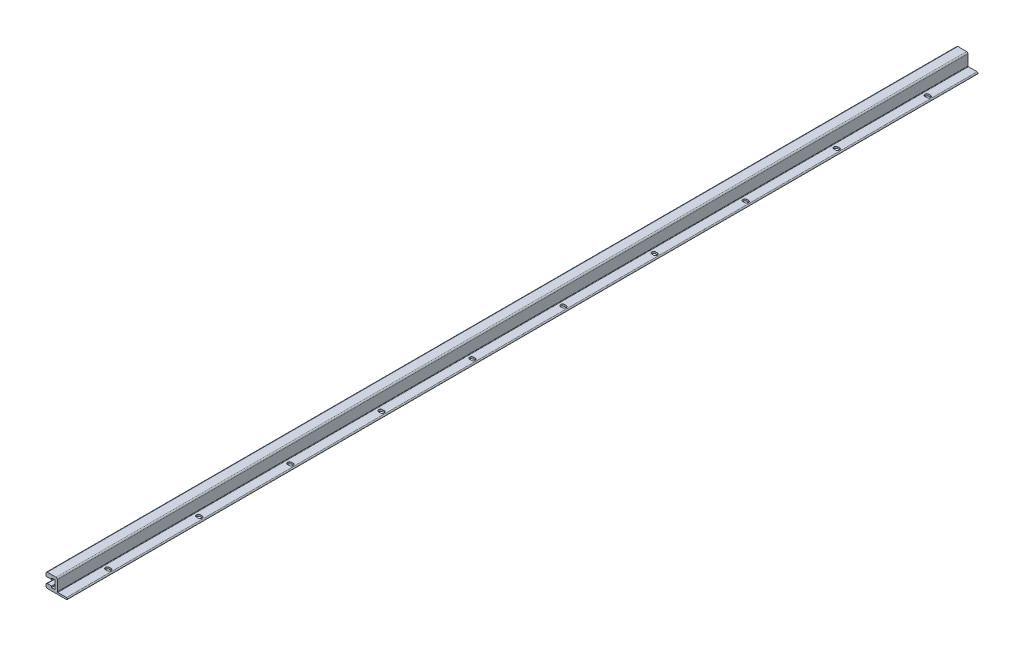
ISO-10303-21;
HEADER;
FILE_DESCRIPTION(('STEP AP214'),'2;1');
FILE_NAME('part.step','',(''),(''),'','','');
FILE_SCHEMA(('AUTOMOTIVE_DESIGN { 1 0 10303 214 1 1 1 1 }'));
ENDSEC;
DATA;
#1=APPLICATION_CONTEXT('core data for automotive mechanical design processes');
#2=APPLICATION_PROTOCOL_DEFINITION('international standard','automotive_design',2000,#1);
#3=PRODUCT_CONTEXT('',#1,'mechanical');
#4=PRODUCT('Part','Part','',(#3));
#5=PRODUCT_RELATED_PRODUCT_CATEGORY('part','',(#4));
#6=PRODUCT_DEFINITION_FORMATION('','',#4);
#7=PRODUCT_DEFINITION_CONTEXT('part definition',#1,'design');
#8=PRODUCT_DEFINITION('design','',#6,#7);
#9=PRODUCT_DEFINITION_SHAPE('','',#8);
#10=(LENGTH_UNIT() NAMED_UNIT(*) SI_UNIT(.MILLI.,.METRE.));
#11=(NAMED_UNIT(*) PLANE_ANGLE_UNIT() SI_UNIT($,.RADIAN.));
#12=(NAMED_UNIT(*) SI_UNIT($,.STERADIAN.) SOLID_ANGLE_UNIT());
#13=UNCERTAINTY_MEASURE_WITH_UNIT(LENGTH_MEASURE(1.E-05),#10,'distance_accuracy_value','');
#14=(GEOMETRIC_REPRESENTATION_CONTEXT(3) GLOBAL_UNCERTAINTY_ASSIGNED_CONTEXT((#13)) GLOBAL_UNIT_ASSIGNED_CONTEXT((#10,
#11,#12)) REPRESENTATION_CONTEXT('',''));
#15=CARTESIAN_POINT('',(0.,0.,0.));
#16=DIRECTION('',(0.,0.,1.));
#17=DIRECTION('',(1.,0.,0.));
#18=AXIS2_PLACEMENT_3D('',#15,#16,#17);
#19=CARTESIAN_POINT('',(-9.5,28.,0.));
#20=DIRECTION('',(0.,0.,1.));
#21=DIRECTION('',(1.,0.,0.));
#22=AXIS2_PLACEMENT_3D('',#19,#20,#21);
#23=CYLINDRICAL_SURFACE('',#22,3.);
#24=CARTESIAN_POINT('',(-9.5,28.,2000.));
#25=DIRECTION('',(0.,0.,1.));
#26=DIRECTION('',(-1.,0.,0.));
#27=AXIS2_PLACEMENT_3D('',#24,#25,#26);
#28=CIRCLE('',#27,3.);
#29=CARTESIAN_POINT('',(-9.5,31.,2000.));
#30=VERTEX_POINT('',#29);
#31=CARTESIAN_POINT('',(-12.5,28.,2000.));
#32=VERTEX_POINT('',#31);
#33=EDGE_CURVE('E703',#30,#32,#28,.T.);
#34=ORIENTED_EDGE('',*,*,#33,.F.);
#35=DIRECTION('',(0.,0.,1.));
#36=VECTOR('',#35,1.);
#37=CARTESIAN_POINT('',(-9.5,31.,0.));
#38=LINE('',#37,#36);
#39=CARTESIAN_POINT('',(-9.5,31.,0.));
#40=VERTEX_POINT('',#39);
#41=EDGE_CURVE('E9',#40,#30,#38,.T.);
#42=ORIENTED_EDGE('',*,*,#41,.F.);
#43=CARTESIAN_POINT('',(-9.5,28.,0.));
#44=DIRECTION('',(0.,0.,1.));
#45=DIRECTION('',(-1.,0.,0.));
#46=AXIS2_PLACEMENT_3D('',#43,#44,#45);
#47=CIRCLE('',#46,3.);
#48=CARTESIAN_POINT('',(-12.5,28.,0.));
#49=VERTEX_POINT('',#48);
#50=EDGE_CURVE('E766',#40,#49,#47,.T.);
#51=ORIENTED_EDGE('',*,*,#50,.T.);
#52=DIRECTION('',(0.,0.,1.));
#53=VECTOR('',#52,1.);
#54=CARTESIAN_POINT('',(-12.5,28.,0.));
#55=LINE('',#54,#53);
#56=EDGE_CURVE('E17',#49,#32,#55,.T.);
#57=ORIENTED_EDGE('',*,*,#56,.T.);
#58=EDGE_LOOP('',(#34,#42,#51,#57));
#59=FACE_BOUND('',#58,.T.);
#60=ADVANCED_FACE('F14',(#59),#23,.T.);
#61=CARTESIAN_POINT('',(-9.5,31.,0.));
#62=DIRECTION('',(0.,1.,0.));
#63=DIRECTION('',(0.,0.,1.));
#64=AXIS2_PLACEMENT_3D('',#61,#62,#63);
#65=PLANE('',#64);
#66=DIRECTION('',(-1.,0.,0.));
#67=VECTOR('',#66,1.);
#68=CARTESIAN_POINT('',(-9.5,31.,2000.));
#69=LINE('',#68,#67);
#70=CARTESIAN_POINT('',(9.5,31.,2000.));
#71=VERTEX_POINT('',#70);
#72=EDGE_CURVE('E763',#71,#30,#69,.T.);
#73=ORIENTED_EDGE('',*,*,#72,.F.);
#74=DIRECTION('',(0.,0.,1.));
#75=VECTOR('',#74,1.);
#76=CARTESIAN_POINT('',(9.5,31.,0.));
#77=LINE('',#76,#75);
#78=CARTESIAN_POINT('',(9.5,31.,0.));
#79=VERTEX_POINT('',#78);
#80=EDGE_CURVE('E22',#79,#71,#77,.T.);
#81=ORIENTED_EDGE('',*,*,#80,.F.);
#82=DIRECTION('',(-1.,0.,0.));
#83=VECTOR('',#82,1.);
#84=CARTESIAN_POINT('',(-9.5,31.,0.));
#85=LINE('',#84,#83);
#86=EDGE_CURVE('E820',#79,#40,#85,.T.);
#87=ORIENTED_EDGE('',*,*,#86,.T.);
#88=ORIENTED_EDGE('',*,*,#41,.T.);
#89=EDGE_LOOP('',(#73,#81,#87,#88));
#90=FACE_BOUND('',#89,.T.);
#91=ADVANCED_FACE('F867',(#90),#65,.T.);
#92=CARTESIAN_POINT('',(9.5,28.,0.));
#93=DIRECTION('',(0.,0.,1.));
#94=DIRECTION('',(1.,0.,0.));
#95=AXIS2_PLACEMENT_3D('',#92,#93,#94);
#96=CYLINDRICAL_SURFACE('',#95,3.);
#97=CARTESIAN_POINT('',(9.5,28.,2000.));
#98=DIRECTION('',(0.,0.,1.));
#99=DIRECTION('',(-1.,0.,0.));
#100=AXIS2_PLACEMENT_3D('',#97,#98,#99);
#101=CIRCLE('',#100,3.);
#102=CARTESIAN_POINT('',(12.5,28.,2000.));
#103=VERTEX_POINT('',#102);
#104=EDGE_CURVE('E760',#103,#71,#101,.T.);
#105=ORIENTED_EDGE('',*,*,#104,.F.);
#106=DIRECTION('',(0.,0.,1.));
#107=VECTOR('',#106,1.);
#108=CARTESIAN_POINT('',(12.5,28.,0.));
#109=LINE('',#108,#107);
#110=CARTESIAN_POINT('',(12.5,28.,0.));
#111=VERTEX_POINT('',#110);
#112=EDGE_CURVE('E824',#111,#103,#109,.T.);
#113=ORIENTED_EDGE('',*,*,#112,.F.);
#114=CARTESIAN_POINT('',(9.5,28.,0.));
#115=DIRECTION('',(0.,0.,1.));
#116=DIRECTION('',(-1.,0.,0.));
#117=AXIS2_PLACEMENT_3D('',#114,#115,#116);
#118=CIRCLE('',#117,3.);
#119=EDGE_CURVE('E817',#111,#79,#118,.T.);
#120=ORIENTED_EDGE('',*,*,#119,.T.);
#121=ORIENTED_EDGE('',*,*,#80,.T.);
#122=EDGE_LOOP('',(#105,#113,#120,#121));
#123=FACE_BOUND('',#122,.T.);
#124=ADVANCED_FACE('F931',(#123),#96,.T.);
#125=CARTESIAN_POINT('',(12.5,5.,0.));
#126=DIRECTION('',(1.,0.,0.));
#127=DIRECTION('',(0.,0.,-1.));
#128=AXIS2_PLACEMENT_3D('',#125,#126,#127);
#129=PLANE('',#128);
#130=DIRECTION('',(0.,1.,0.));
#131=VECTOR('',#130,1.);
#132=CARTESIAN_POINT('',(12.5,5.,2000.));
#133=LINE('',#132,#131);
#134=CARTESIAN_POINT('',(12.5,5.,2000.));
#135=VERTEX_POINT('',#134);
#136=EDGE_CURVE('E757',#135,#103,#133,.T.);
#137=ORIENTED_EDGE('',*,*,#136,.F.);
#138=DIRECTION('',(0.,0.,1.));
#139=VECTOR('',#138,1.);
#140=CARTESIAN_POINT('',(12.5,5.,0.));
#141=LINE('',#140,#139);
#142=CARTESIAN_POINT('',(12.5,5.,0.));
#143=VERTEX_POINT('',#142);
#144=EDGE_CURVE('E826',#143,#135,#141,.T.);
#145=ORIENTED_EDGE('',*,*,#144,.F.);
#146=DIRECTION('',(0.,1.,0.));
#147=VECTOR('',#146,1.);
#148=CARTESIAN_POINT('',(12.5,5.,0.));
#149=LINE('',#148,#147);
#150=EDGE_CURVE('E814',#143,#111,#149,.T.);
#151=ORIENTED_EDGE('',*,*,#150,.T.);
#152=ORIENTED_EDGE('',*,*,#112,.T.);
#153=EDGE_LOOP('',(#137,#145,#151,#152));
#154=FACE_BOUND('',#153,.T.);
#155=ADVANCED_FACE('F929',(#154),#129,.T.);
#156=CARTESIAN_POINT('',(13.5,5.,0.));
#157=DIRECTION('',(0.,0.,1.));
#158=DIRECTION('',(1.,0.,0.));
#159=AXIS2_PLACEMENT_3D('',#156,#157,#158);
#160=CYLINDRICAL_SURFACE('',#159,1.);
#161=CARTESIAN_POINT('',(13.5,5.,2000.));
#162=DIRECTION('',(0.,0.,-1.));
#163=DIRECTION('',(-1.,0.,0.));
#164=AXIS2_PLACEMENT_3D('',#161,#162,#163);
#165=CIRCLE('',#164,1.);
#166=CARTESIAN_POINT('',(13.5,4.,2000.));
#167=VERTEX_POINT('',#166);
#168=EDGE_CURVE('E754',#167,#135,#165,.T.);
#169=ORIENTED_EDGE('',*,*,#168,.F.);
#170=DIRECTION('',(0.,0.,1.));
#171=VECTOR('',#170,1.);
#172=CARTESIAN_POINT('',(13.5,4.,0.));
#173=LINE('',#172,#171);
#174=CARTESIAN_POINT('',(13.5,4.,0.));
#175=VERTEX_POINT('',#174);
#176=EDGE_CURVE('E828',#175,#167,#173,.T.);
#177=ORIENTED_EDGE('',*,*,#176,.F.);
#178=CARTESIAN_POINT('',(13.5,5.,0.));
#179=DIRECTION('',(0.,0.,-1.));
#180=DIRECTION('',(-1.,0.,0.));
#181=AXIS2_PLACEMENT_3D('',#178,#179,#180);
#182=CIRCLE('',#181,1.);
#183=EDGE_CURVE('E811',#175,#143,#182,.T.);
#184=ORIENTED_EDGE('',*,*,#183,.T.);
#185=ORIENTED_EDGE('',*,*,#144,.T.);
#186=EDGE_LOOP('',(#169,#177,#184,#185));
#187=FACE_BOUND('',#186,.T.);
#188=ADVANCED_FACE('F925',(#187),#160,.F.);
#189=CARTESIAN_POINT('',(13.5,4.,0.));
#190=DIRECTION('',(0.,1.,0.));
#191=DIRECTION('',(0.,0.,1.));
#192=AXIS2_PLACEMENT_3D('',#189,#190,#191);
#193=PLANE('',#192);
#194=CARTESIAN_POINT('',(22.199999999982,4.,100.));
#195=DIRECTION('',(0.,1.,0.));
#196=DIRECTION('',(0.,0.,1.));
#197=AXIS2_PLACEMENT_3D('',#194,#195,#196);
#198=CIRCLE('',#197,4.25);
#199=CARTESIAN_POINT('',(22.1999999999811,4.,95.75));
#200=VERTEX_POINT('',#199);
#201=CARTESIAN_POINT('',(22.1999999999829,4.,104.25));
#202=VERTEX_POINT('',#201);
#203=EDGE_CURVE('E30',#200,#202,#198,.T.);
#204=ORIENTED_EDGE('',*,*,#203,.F.);
#205=DIRECTION('',(-1.,0.,0.));
#206=VECTOR('',#205,1.);
#207=CARTESIAN_POINT('',(26.1999999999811,4.,95.75));
#208=LINE('',#207,#206);
#209=CARTESIAN_POINT('',(26.1999999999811,4.,95.75));
#210=VERTEX_POINT('',#209);
#211=EDGE_CURVE('E403',#210,#200,#208,.T.);
#212=ORIENTED_EDGE('',*,*,#211,.F.);
#213=CARTESIAN_POINT('',(26.1999999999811,4.,100.));
#214=DIRECTION('',(0.,1.,0.));
#215=DIRECTION('',(0.,0.,1.));
#216=AXIS2_PLACEMENT_3D('',#213,#214,#215);
#217=CIRCLE('',#216,4.25);
#218=CARTESIAN_POINT('',(26.1999999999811,4.,104.25));
#219=VERTEX_POINT('',#218);
#220=EDGE_CURVE('E387',#219,#210,#217,.T.);
#221=ORIENTED_EDGE('',*,*,#220,.F.);
#222=DIRECTION('',(1.,0.,0.));
#223=VECTOR('',#222,1.);
#224=CARTESIAN_POINT('',(26.1999999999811,4.,104.25));
#225=LINE('',#224,#223);
#226=EDGE_CURVE('E396',#202,#219,#225,.T.);
#227=ORIENTED_EDGE('',*,*,#226,.F.);
#228=EDGE_LOOP('',(#204,#212,#221,#227));
#229=FACE_BOUND('',#228,.T.);
#230=CARTESIAN_POINT('',(22.1999999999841,4.,300.));
#231=DIRECTION('',(0.,1.,0.));
#232=DIRECTION('',(0.,0.,1.));
#233=AXIS2_PLACEMENT_3D('',#230,#231,#232);
#234=CIRCLE('',#233,4.25);
#235=CARTESIAN_POINT('',(22.1999999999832,4.,295.75));
#236=VERTEX_POINT('',#235);
#237=CARTESIAN_POINT('',(22.199999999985,4.,304.25));
#238=VERTEX_POINT('',#237);
#239=EDGE_CURVE('E419',#236,#238,#234,.T.);
#240=ORIENTED_EDGE('',*,*,#239,.F.);
#241=DIRECTION('',(-1.,0.,0.));
#242=VECTOR('',#241,1.);
#243=CARTESIAN_POINT('',(26.1999999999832,4.,295.75));
#244=LINE('',#243,#242);
#245=CARTESIAN_POINT('',(26.1999999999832,4.,295.75));
#246=VERTEX_POINT('',#245);
#247=EDGE_CURVE('E429',#246,#236,#244,.T.);
#248=ORIENTED_EDGE('',*,*,#247,.F.);
#249=CARTESIAN_POINT('',(26.1999999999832,4.,300.));
#250=DIRECTION('',(0.,1.,0.));
#251=DIRECTION('',(0.,0.,1.));
#252=AXIS2_PLACEMENT_3D('',#249,#250,#251);
#253=CIRCLE('',#252,4.25);
#254=CARTESIAN_POINT('',(26.1999999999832,4.,304.25));
#255=VERTEX_POINT('',#254);
#256=EDGE_CURVE('E426',#255,#246,#253,.T.);
#257=ORIENTED_EDGE('',*,*,#256,.F.);
#258=DIRECTION('',(1.,0.,0.));
#259=VECTOR('',#258,1.);
#260=CARTESIAN_POINT('',(26.1999999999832,4.,304.25));
#261=LINE('',#260,#259);
#262=EDGE_CURVE('E423',#238,#255,#261,.T.);
#263=ORIENTED_EDGE('',*,*,#262,.F.);
#264=EDGE_LOOP('',(#240,#248,#257,#263));
#265=FACE_BOUND('',#264,.T.);
#266=CARTESIAN_POINT('',(22.1999999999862,4.,500.));
#267=DIRECTION('',(0.,1.,0.));
#268=DIRECTION('',(0.,0.,1.));
#269=AXIS2_PLACEMENT_3D('',#266,#267,#268);
#270=CIRCLE('',#269,4.25);
#271=CARTESIAN_POINT('',(22.1999999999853,4.,495.75));
#272=VERTEX_POINT('',#271);
#273=CARTESIAN_POINT('',(22.199999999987,4.,504.25));
#274=VERTEX_POINT('',#273);
#275=EDGE_CURVE('E447',#272,#274,#270,.T.);
#276=ORIENTED_EDGE('',*,*,#275,.F.);
#277=DIRECTION('',(-1.,0.,0.));
#278=VECTOR('',#277,1.);
#279=CARTESIAN_POINT('',(26.1999999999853,4.,495.75));
#280=LINE('',#279,#278);
#281=CARTESIAN_POINT('',(26.1999999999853,4.,495.75));
#282=VERTEX_POINT('',#281);
#283=EDGE_CURVE('E461',#282,#272,#280,.T.);
#284=ORIENTED_EDGE('',*,*,#283,.F.);
#285=CARTESIAN_POINT('',(26.1999999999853,4.,500.));
#286=DIRECTION('',(0.,1.,0.));
#287=DIRECTION('',(0.,0.,1.));
#288=AXIS2_PLACEMENT_3D('',#285,#286,#287);
#289=CIRCLE('',#288,4.25);
#290=CARTESIAN_POINT('',(26.1999999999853,4.,504.25));
#291=VERTEX_POINT('',#290);
#292=EDGE_CURVE('E458',#291,#282,#289,.T.);
#293=ORIENTED_EDGE('',*,*,#292,.F.);
#294=DIRECTION('',(1.,0.,0.));
#295=VECTOR('',#294,1.);
#296=CARTESIAN_POINT('',(26.1999999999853,4.,504.25));
#297=LINE('',#296,#295);
#298=EDGE_CURVE('E455',#274,#291,#297,.T.);
#299=ORIENTED_EDGE('',*,*,#298,.F.);
#300=EDGE_LOOP('',(#276,#284,#293,#299));
#301=FACE_BOUND('',#300,.T.);
#302=CARTESIAN_POINT('',(22.1999999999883,4.,700.));
#303=DIRECTION('',(0.,1.,0.));
#304=DIRECTION('',(0.,0.,1.));
#305=AXIS2_PLACEMENT_3D('',#302,#303,#304);
#306=CIRCLE('',#305,4.25);
#307=CARTESIAN_POINT('',(22.1999999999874,4.,695.75));
#308=VERTEX_POINT('',#307);
#309=CARTESIAN_POINT('',(22.1999999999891,4.,704.25));
#310=VERTEX_POINT('',#309);
#311=EDGE_CURVE('E479',#308,#310,#306,.T.);
#312=ORIENTED_EDGE('',*,*,#311,.F.);
#313=DIRECTION('',(-1.,0.,0.));
#314=VECTOR('',#313,1.);
#315=CARTESIAN_POINT('',(26.1999999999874,4.,695.75));
#316=LINE('',#315,#314);
#317=CARTESIAN_POINT('',(26.1999999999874,4.,695.75));
#318=VERTEX_POINT('',#317);
#319=EDGE_CURVE('E493',#318,#308,#316,.T.);
#320=ORIENTED_EDGE('',*,*,#319,.F.);
#321=CARTESIAN_POINT('',(26.1999999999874,4.,700.));
#322=DIRECTION('',(0.,1.,0.));
#323=DIRECTION('',(0.,0.,1.));
#324=AXIS2_PLACEMENT_3D('',#321,#322,#323);
#325=CIRCLE('',#324,4.25);
#326=CARTESIAN_POINT('',(26.1999999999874,4.,704.25));
#327=VERTEX_POINT('',#326);
#328=EDGE_CURVE('E490',#327,#318,#325,.T.);
#329=ORIENTED_EDGE('',*,*,#328,.F.);
#330=DIRECTION('',(1.,0.,0.));
#331=VECTOR('',#330,1.);
#332=CARTESIAN_POINT('',(26.1999999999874,4.,704.25));
#333=LINE('',#332,#331);
#334=EDGE_CURVE('E487',#310,#327,#333,.T.);
#335=ORIENTED_EDGE('',*,*,#334,.F.);
#336=EDGE_LOOP('',(#312,#320,#329,#335));
#337=FACE_BOUND('',#336,.T.);
#338=CARTESIAN_POINT('',(22.1999999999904,4.,900.));
#339=DIRECTION('',(0.,1.,0.));
#340=DIRECTION('',(0.,0.,1.));
#341=AXIS2_PLACEMENT_3D('',#338,#339,#340);
#342=CIRCLE('',#341,4.25);
#343=CARTESIAN_POINT('',(22.1999999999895,4.,895.75));
#344=VERTEX_POINT('',#343);
#345=CARTESIAN_POINT('',(22.1999999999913,4.,904.25));
#346=VERTEX_POINT('',#345);
#347=EDGE_CURVE('E511',#344,#346,#342,.T.);
#348=ORIENTED_EDGE('',*,*,#347,.F.);
#349=DIRECTION('',(-1.,0.,0.));
#350=VECTOR('',#349,1.);
#351=CARTESIAN_POINT('',(26.1999999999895,4.,895.75));
#352=LINE('',#351,#350);
#353=CARTESIAN_POINT('',(26.1999999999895,4.,895.75));
#354=VERTEX_POINT('',#353);
#355=EDGE_CURVE('E525',#354,#344,#352,.T.);
#356=ORIENTED_EDGE('',*,*,#355,.F.);
#357=CARTESIAN_POINT('',(26.1999999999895,4.,900.));
#358=DIRECTION('',(0.,1.,0.));
#359=DIRECTION('',(0.,0.,1.));
#360=AXIS2_PLACEMENT_3D('',#357,#358,#359);
#361=CIRCLE('',#360,4.25);
#362=CARTESIAN_POINT('',(26.1999999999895,4.,904.25));
#363=VERTEX_POINT('',#362);
#364=EDGE_CURVE('E522',#363,#354,#361,.T.);
#365=ORIENTED_EDGE('',*,*,#364,.F.);
#366=DIRECTION('',(1.,0.,0.));
#367=VECTOR('',#366,1.);
#368=CARTESIAN_POINT('',(26.1999999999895,4.,904.25));
#369=LINE('',#368,#367);
#370=EDGE_CURVE('E519',#346,#363,#369,.T.);
#371=ORIENTED_EDGE('',*,*,#370,.F.);
#372=EDGE_LOOP('',(#348,#356,#365,#371));
#373=FACE_BOUND('',#372,.T.);
#374=CARTESIAN_POINT('',(22.1999999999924,4.,1100.));
#375=DIRECTION('',(0.,1.,0.));
#376=DIRECTION('',(0.,0.,1.));
#377=AXIS2_PLACEMENT_3D('',#374,#375,#376);
#378=CIRCLE('',#377,4.25);
#379=CARTESIAN_POINT('',(22.1999999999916,4.,1095.75));
#380=VERTEX_POINT('',#379);
#381=CARTESIAN_POINT('',(22.1999999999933,4.,1104.25));
#382=VERTEX_POINT('',#381);
#383=EDGE_CURVE('E543',#380,#382,#378,.T.);
#384=ORIENTED_EDGE('',*,*,#383,.F.);
#385=DIRECTION('',(-1.,0.,0.));
#386=VECTOR('',#385,1.);
#387=CARTESIAN_POINT('',(26.1999999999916,4.,1095.75));
#388=LINE('',#387,#386);
#389=CARTESIAN_POINT('',(26.1999999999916,4.,1095.75));
#390=VERTEX_POINT('',#389);
#391=EDGE_CURVE('E557',#390,#380,#388,.T.);
#392=ORIENTED_EDGE('',*,*,#391,.F.);
#393=CARTESIAN_POINT('',(26.1999999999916,4.,1100.));
#394=DIRECTION('',(0.,1.,0.));
#395=DIRECTION('',(0.,0.,1.));
#396=AXIS2_PLACEMENT_3D('',#393,#394,#395);
#397=CIRCLE('',#396,4.25);
#398=CARTESIAN_POINT('',(26.1999999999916,4.,1104.25));
#399=VERTEX_POINT('',#398);
#400=EDGE_CURVE('E554',#399,#390,#397,.T.);
#401=ORIENTED_EDGE('',*,*,#400,.F.);
#402=DIRECTION('',(1.,0.,0.));
#403=VECTOR('',#402,1.);
#404=CARTESIAN_POINT('',(26.1999999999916,4.,1104.25));
#405=LINE('',#404,#403);
#406=EDGE_CURVE('E551',#382,#399,#405,.T.);
#407=ORIENTED_EDGE('',*,*,#406,.F.);
#408=EDGE_LOOP('',(#384,#392,#401,#407));
#409=FACE_BOUND('',#408,.T.);
#410=CARTESIAN_POINT('',(22.1999999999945,4.,1300.));
#411=DIRECTION('',(0.,1.,0.));
#412=DIRECTION('',(0.,0.,1.));
#413=AXIS2_PLACEMENT_3D('',#410,#411,#412);
#414=CIRCLE('',#413,4.25);
#415=CARTESIAN_POINT('',(22.1999999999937,4.,1295.75));
#416=VERTEX_POINT('',#415);
#417=CARTESIAN_POINT('',(22.1999999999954,4.,1304.25));
#418=VERTEX_POINT('',#417);
#419=EDGE_CURVE('E575',#416,#418,#414,.T.);
#420=ORIENTED_EDGE('',*,*,#419,.F.);
#421=DIRECTION('',(-1.,0.,0.));
#422=VECTOR('',#421,1.);
#423=CARTESIAN_POINT('',(26.1999999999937,4.,1295.75));
#424=LINE('',#423,#422);
#425=CARTESIAN_POINT('',(26.1999999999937,4.,1295.75));
#426=VERTEX_POINT('',#425);
#427=EDGE_CURVE('E589',#426,#416,#424,.T.);
#428=ORIENTED_EDGE('',*,*,#427,.F.);
#429=CARTESIAN_POINT('',(26.1999999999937,4.,1300.));
#430=DIRECTION('',(0.,1.,0.));
#431=DIRECTION('',(0.,0.,1.));
#432=AXIS2_PLACEMENT_3D('',#429,#430,#431);
#433=CIRCLE('',#432,4.25);
#434=CARTESIAN_POINT('',(26.1999999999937,4.,1304.25));
#435=VERTEX_POINT('',#434);
#436=EDGE_CURVE('E586',#435,#426,#433,.T.);
#437=ORIENTED_EDGE('',*,*,#436,.F.);
#438=DIRECTION('',(1.,0.,0.));
#439=VECTOR('',#438,1.);
#440=CARTESIAN_POINT('',(26.1999999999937,4.,1304.25));
#441=LINE('',#440,#439);
#442=EDGE_CURVE('E583',#418,#435,#441,.T.);
#443=ORIENTED_EDGE('',*,*,#442,.F.);
#444=EDGE_LOOP('',(#420,#428,#437,#443));
#445=FACE_BOUND('',#444,.T.);
#446=CARTESIAN_POINT('',(22.1999999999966,4.,1500.));
#447=DIRECTION('',(0.,1.,0.));
#448=DIRECTION('',(0.,0.,1.));
#449=AXIS2_PLACEMENT_3D('',#446,#447,#448);
#450=CIRCLE('',#449,4.25);
#451=CARTESIAN_POINT('',(22.1999999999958,4.,1495.75));
#452=VERTEX_POINT('',#451);
#453=CARTESIAN_POINT('',(22.1999999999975,4.,1504.25));
#454=VERTEX_POINT('',#453);
#455=EDGE_CURVE('E607',#452,#454,#450,.T.);
#456=ORIENTED_EDGE('',*,*,#455,.F.);
#457=DIRECTION('',(-1.,0.,0.));
#458=VECTOR('',#457,1.);
#459=CARTESIAN_POINT('',(26.1999999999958,4.,1495.75));
#460=LINE('',#459,#458);
#461=CARTESIAN_POINT('',(26.1999999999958,4.,1495.75));
#462=VERTEX_POINT('',#461);
#463=EDGE_CURVE('E621',#462,#452,#460,.T.);
#464=ORIENTED_EDGE('',*,*,#463,.F.);
#465=CARTESIAN_POINT('',(26.1999999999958,4.,1500.));
#466=DIRECTION('',(0.,1.,0.));
#467=DIRECTION('',(0.,0.,1.));
#468=AXIS2_PLACEMENT_3D('',#465,#466,#467);
#469=CIRCLE('',#468,4.25);
#470=CARTESIAN_POINT('',(26.1999999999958,4.,1504.25));
#471=VERTEX_POINT('',#470);
#472=EDGE_CURVE('E618',#471,#462,#469,.T.);
#473=ORIENTED_EDGE('',*,*,#472,.F.);
#474=DIRECTION('',(1.,0.,0.));
#475=VECTOR('',#474,1.);
#476=CARTESIAN_POINT('',(26.1999999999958,4.,1504.25));
#477=LINE('',#476,#475);
#478=EDGE_CURVE('E615',#454,#471,#477,.T.);
#479=ORIENTED_EDGE('',*,*,#478,.F.);
#480=EDGE_LOOP('',(#456,#464,#473,#479));
#481=FACE_BOUND('',#480,.T.);
#482=CARTESIAN_POINT('',(22.1999999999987,4.,1700.));
#483=DIRECTION('',(0.,1.,0.));
#484=DIRECTION('',(0.,0.,1.));
#485=AXIS2_PLACEMENT_3D('',#482,#483,#484);
#486=CIRCLE('',#485,4.25);
#487=CARTESIAN_POINT('',(22.1999999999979,4.,1695.75));
#488=VERTEX_POINT('',#487);
#489=CARTESIAN_POINT('',(22.1999999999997,4.,1704.25));
#490=VERTEX_POINT('',#489);
#491=EDGE_CURVE('E639',#488,#490,#486,.T.);
#492=ORIENTED_EDGE('',*,*,#491,.F.);
#493=DIRECTION('',(-1.,0.,0.));
#494=VECTOR('',#493,1.);
#495=CARTESIAN_POINT('',(26.1999999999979,4.,1695.75));
#496=LINE('',#495,#494);
#497=CARTESIAN_POINT('',(26.1999999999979,4.,1695.75));
#498=VERTEX_POINT('',#497);
#499=EDGE_CURVE('E653',#498,#488,#496,.T.);
#500=ORIENTED_EDGE('',*,*,#499,.F.);
#501=CARTESIAN_POINT('',(26.1999999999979,4.,1700.));
#502=DIRECTION('',(0.,1.,0.));
#503=DIRECTION('',(0.,0.,1.));
#504=AXIS2_PLACEMENT_3D('',#501,#502,#503);
#505=CIRCLE('',#504,4.25);
#506=CARTESIAN_POINT('',(26.1999999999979,4.,1704.25));
#507=VERTEX_POINT('',#506);
#508=EDGE_CURVE('E650',#507,#498,#505,.T.);
#509=ORIENTED_EDGE('',*,*,#508,.F.);
#510=DIRECTION('',(1.,0.,0.));
#511=VECTOR('',#510,1.);
#512=CARTESIAN_POINT('',(26.1999999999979,4.,1704.25));
#513=LINE('',#512,#511);
#514=EDGE_CURVE('E647',#490,#507,#513,.T.);
#515=ORIENTED_EDGE('',*,*,#514,.F.);
#516=EDGE_LOOP('',(#492,#500,#509,#515));
#517=FACE_BOUND('',#516,.T.);
#518=CARTESIAN_POINT('',(22.2000000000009,4.,1900.));
#519=DIRECTION('',(0.,1.,0.));
#520=DIRECTION('',(0.,0.,1.));
#521=AXIS2_PLACEMENT_3D('',#518,#519,#520);
#522=CIRCLE('',#521,4.25);
#523=CARTESIAN_POINT('',(22.2,4.,1895.75));
#524=VERTEX_POINT('',#523);
#525=CARTESIAN_POINT('',(22.2000000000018,4.,1904.25));
#526=VERTEX_POINT('',#525);
#527=EDGE_CURVE('E671',#524,#526,#522,.T.);
#528=ORIENTED_EDGE('',*,*,#527,.F.);
#529=DIRECTION('',(-1.,0.,0.));
#530=VECTOR('',#529,1.);
#531=CARTESIAN_POINT('',(26.2,4.,1895.75));
#532=LINE('',#531,#530);
#533=CARTESIAN_POINT('',(26.2,4.,1895.75));
#534=VERTEX_POINT('',#533);
#535=EDGE_CURVE('E685',#534,#524,#532,.T.);
#536=ORIENTED_EDGE('',*,*,#535,.F.);
#537=CARTESIAN_POINT('',(26.2,4.,1900.));
#538=DIRECTION('',(0.,1.,0.));
#539=DIRECTION('',(0.,0.,1.));
#540=AXIS2_PLACEMENT_3D('',#537,#538,#539);
#541=CIRCLE('',#540,4.25);
#542=CARTESIAN_POINT('',(26.2,4.,1904.25));
#543=VERTEX_POINT('',#542);
#544=EDGE_CURVE('E682',#543,#534,#541,.T.);
#545=ORIENTED_EDGE('',*,*,#544,.F.);
#546=DIRECTION('',(1.,0.,0.));
#547=VECTOR('',#546,1.);
#548=CARTESIAN_POINT('',(26.2,4.,1904.25));
#549=LINE('',#548,#547);
#550=EDGE_CURVE('E679',#526,#543,#549,.T.);
#551=ORIENTED_EDGE('',*,*,#550,.F.);
#552=EDGE_LOOP('',(#528,#536,#545,#551));
#553=FACE_BOUND('',#552,.T.);
#554=DIRECTION('',(-1.,0.,0.));
#555=VECTOR('',#554,1.);
#556=CARTESIAN_POINT('',(13.5,4.,2000.));
#557=LINE('',#556,#555);
#558=CARTESIAN_POINT('',(32.5,4.,2000.));
#559=VERTEX_POINT('',#558);
#560=EDGE_CURVE('E751',#559,#167,#557,.T.);
#561=ORIENTED_EDGE('',*,*,#560,.F.);
#562=DIRECTION('',(0.,0.,1.));
#563=VECTOR('',#562,1.);
#564=CARTESIAN_POINT('',(32.5,4.,0.));
#565=LINE('',#564,#563);
#566=CARTESIAN_POINT('',(32.5,4.,0.));
#567=VERTEX_POINT('',#566);
#568=EDGE_CURVE('E830',#567,#559,#565,.T.);
#569=ORIENTED_EDGE('',*,*,#568,.F.);
#570=DIRECTION('',(-1.,0.,0.));
#571=VECTOR('',#570,1.);
#572=CARTESIAN_POINT('',(13.5,4.,0.));
#573=LINE('',#572,#571);
#574=EDGE_CURVE('E808',#567,#175,#573,.T.);
#575=ORIENTED_EDGE('',*,*,#574,.T.);
#576=ORIENTED_EDGE('',*,*,#176,.T.);
#577=EDGE_LOOP('',(#561,#569,#575,#576));
#578=FACE_BOUND('',#577,.T.);
#579=ADVANCED_FACE('F400',(#229,#265,#301,#337,#373,#409,#445,#481,#517,#553,#578),#193,.T.);
#580=CARTESIAN_POINT('',(32.5,2.,0.));
#581=DIRECTION('',(0.,0.,1.));
#582=DIRECTION('',(1.,0.,0.));
#583=AXIS2_PLACEMENT_3D('',#580,#581,#582);
#584=CYLINDRICAL_SURFACE('',#583,2.);
#585=CARTESIAN_POINT('',(32.5,2.,2000.));
#586=DIRECTION('',(0.,0.,1.));
#587=DIRECTION('',(1.,0.,0.));
#588=AXIS2_PLACEMENT_3D('',#585,#586,#587);
#589=CIRCLE('',#588,2.);
#590=CARTESIAN_POINT('',(32.5,0.,2000.));
#591=VERTEX_POINT('',#590);
#592=EDGE_CURVE('E748',#591,#559,#589,.T.);
#593=ORIENTED_EDGE('',*,*,#592,.F.);
#594=DIRECTION('',(0.,0.,1.));
#595=VECTOR('',#594,1.);
#596=CARTESIAN_POINT('',(32.5,0.,0.));
#597=LINE('',#596,#595);
#598=CARTESIAN_POINT('',(32.5,0.,0.));
#599=VERTEX_POINT('',#598);
#600=EDGE_CURVE('E832',#599,#591,#597,.T.);
#601=ORIENTED_EDGE('',*,*,#600,.F.);
#602=CARTESIAN_POINT('',(32.5,2.,0.));
#603=DIRECTION('',(0.,0.,1.));
#604=DIRECTION('',(1.,0.,0.));
#605=AXIS2_PLACEMENT_3D('',#602,#603,#604);
#606=CIRCLE('',#605,2.);
#607=EDGE_CURVE('E805',#599,#567,#606,.T.);
#608=ORIENTED_EDGE('',*,*,#607,.T.);
#609=ORIENTED_EDGE('',*,*,#568,.T.);
#610=EDGE_LOOP('',(#593,#601,#608,#609));
#611=FACE_BOUND('',#610,.T.);
#612=ADVANCED_FACE('F918',(#611),#584,.T.);
#613=CARTESIAN_POINT('',(-9.5,0.,0.));
#614=DIRECTION('',(0.,-1.,0.));
#615=DIRECTION('',(0.,0.,-1.));
#616=AXIS2_PLACEMENT_3D('',#613,#614,#615);
#617=PLANE('',#616);
#618=CARTESIAN_POINT('',(22.199999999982,0.,100.));
#619=DIRECTION('',(0.,1.,0.));
#620=DIRECTION('',(0.,0.,1.));
#621=AXIS2_PLACEMENT_3D('',#618,#619,#620);
#622=CIRCLE('',#621,4.25);
#623=CARTESIAN_POINT('',(22.1999999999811,0.,95.75));
#624=VERTEX_POINT('',#623);
#625=CARTESIAN_POINT('',(22.1999999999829,0.,104.25));
#626=VERTEX_POINT('',#625);
#627=EDGE_CURVE('E405',#624,#626,#622,.T.);
#628=ORIENTED_EDGE('',*,*,#627,.T.);
#629=DIRECTION('',(1.,0.,0.));
#630=VECTOR('',#629,1.);
#631=CARTESIAN_POINT('',(26.1999999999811,0.,104.25));
#632=LINE('',#631,#630);
#633=CARTESIAN_POINT('',(26.1999999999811,0.,104.25));
#634=VERTEX_POINT('',#633);
#635=EDGE_CURVE('E411',#626,#634,#632,.T.);
#636=ORIENTED_EDGE('',*,*,#635,.T.);
#637=CARTESIAN_POINT('',(26.1999999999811,0.,100.));
#638=DIRECTION('',(0.,1.,0.));
#639=DIRECTION('',(0.,0.,1.));
#640=AXIS2_PLACEMENT_3D('',#637,#638,#639);
#641=CIRCLE('',#640,4.25);
#642=CARTESIAN_POINT('',(26.1999999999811,0.,95.75));
#643=VERTEX_POINT('',#642);
#644=EDGE_CURVE('E38',#634,#643,#641,.T.);
#645=ORIENTED_EDGE('',*,*,#644,.T.);
#646=DIRECTION('',(-1.,0.,0.));
#647=VECTOR('',#646,1.);
#648=CARTESIAN_POINT('',(26.1999999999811,0.,95.75));
#649=LINE('',#648,#647);
#650=EDGE_CURVE('E414',#643,#624,#649,.T.);
#651=ORIENTED_EDGE('',*,*,#650,.T.);
#652=EDGE_LOOP('',(#628,#636,#645,#651));
#653=FACE_BOUND('',#652,.T.);
#654=CARTESIAN_POINT('',(22.1999999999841,0.,300.));
#655=DIRECTION('',(0.,1.,0.));
#656=DIRECTION('',(0.,0.,1.));
#657=AXIS2_PLACEMENT_3D('',#654,#655,#656);
#658=CIRCLE('',#657,4.25);
#659=CARTESIAN_POINT('',(22.1999999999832,0.,295.75));
#660=VERTEX_POINT('',#659);
#661=CARTESIAN_POINT('',(22.199999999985,0.,304.25));
#662=VERTEX_POINT('',#661);
#663=EDGE_CURVE('E432',#660,#662,#658,.T.);
#664=ORIENTED_EDGE('',*,*,#663,.T.);
#665=DIRECTION('',(1.,0.,0.));
#666=VECTOR('',#665,1.);
#667=CARTESIAN_POINT('',(26.1999999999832,0.,304.25));
#668=LINE('',#667,#666);
#669=CARTESIAN_POINT('',(26.1999999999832,0.,304.25));
#670=VERTEX_POINT('',#669);
#671=EDGE_CURVE('E435',#662,#670,#668,.T.);
#672=ORIENTED_EDGE('',*,*,#671,.T.);
#673=CARTESIAN_POINT('',(26.1999999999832,0.,300.));
#674=DIRECTION('',(0.,1.,0.));
#675=DIRECTION('',(0.,0.,1.));
#676=AXIS2_PLACEMENT_3D('',#673,#674,#675);
#677=CIRCLE('',#676,4.25);
#678=CARTESIAN_POINT('',(26.1999999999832,0.,295.75));
#679=VERTEX_POINT('',#678);
#680=EDGE_CURVE('E438',#670,#679,#677,.T.);
#681=ORIENTED_EDGE('',*,*,#680,.T.);
#682=DIRECTION('',(-1.,0.,0.));
#683=VECTOR('',#682,1.);
#684=CARTESIAN_POINT('',(26.1999999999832,0.,295.75));
#685=LINE('',#684,#683);
#686=EDGE_CURVE('E441',#679,#660,#685,.T.);
#687=ORIENTED_EDGE('',*,*,#686,.T.);
#688=EDGE_LOOP('',(#664,#672,#681,#687));
#689=FACE_BOUND('',#688,.T.);
#690=CARTESIAN_POINT('',(22.1999999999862,0.,500.));
#691=DIRECTION('',(0.,1.,0.));
#692=DIRECTION('',(0.,0.,1.));
#693=AXIS2_PLACEMENT_3D('',#690,#691,#692);
#694=CIRCLE('',#693,4.25);
#695=CARTESIAN_POINT('',(22.1999999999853,0.,495.75));
#696=VERTEX_POINT('',#695);
#697=CARTESIAN_POINT('',(22.199999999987,0.,504.25));
#698=VERTEX_POINT('',#697);
#699=EDGE_CURVE('E464',#696,#698,#694,.T.);
#700=ORIENTED_EDGE('',*,*,#699,.T.);
#701=DIRECTION('',(1.,0.,0.));
#702=VECTOR('',#701,1.);
#703=CARTESIAN_POINT('',(26.1999999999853,0.,504.25));
#704=LINE('',#703,#702);
#705=CARTESIAN_POINT('',(26.1999999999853,0.,504.25));
#706=VERTEX_POINT('',#705);
#707=EDGE_CURVE('E467',#698,#706,#704,.T.);
#708=ORIENTED_EDGE('',*,*,#707,.T.);
#709=CARTESIAN_POINT('',(26.1999999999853,0.,500.));
#710=DIRECTION('',(0.,1.,0.));
#711=DIRECTION('',(0.,0.,1.));
#712=AXIS2_PLACEMENT_3D('',#709,#710,#711);
#713=CIRCLE('',#712,4.25);
#714=CARTESIAN_POINT('',(26.1999999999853,0.,495.75));
#715=VERTEX_POINT('',#714);
#716=EDGE_CURVE('E470',#706,#715,#713,.T.);
#717=ORIENTED_EDGE('',*,*,#716,.T.);
#718=DIRECTION('',(-1.,0.,0.));
#719=VECTOR('',#718,1.);
#720=CARTESIAN_POINT('',(26.1999999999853,0.,495.75));
#721=LINE('',#720,#719);
#722=EDGE_CURVE('E473',#715,#696,#721,.T.);
#723=ORIENTED_EDGE('',*,*,#722,.T.);
#724=EDGE_LOOP('',(#700,#708,#717,#723));
#725=FACE_BOUND('',#724,.T.);
#726=CARTESIAN_POINT('',(22.1999999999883,0.,700.));
#727=DIRECTION('',(0.,1.,0.));
#728=DIRECTION('',(0.,0.,1.));
#729=AXIS2_PLACEMENT_3D('',#726,#727,#728);
#730=CIRCLE('',#729,4.25);
#731=CARTESIAN_POINT('',(22.1999999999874,0.,695.75));
#732=VERTEX_POINT('',#731);
#733=CARTESIAN_POINT('',(22.1999999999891,0.,704.25));
#734=VERTEX_POINT('',#733);
#735=EDGE_CURVE('E496',#732,#734,#730,.T.);
#736=ORIENTED_EDGE('',*,*,#735,.T.);
#737=DIRECTION('',(1.,0.,0.));
#738=VECTOR('',#737,1.);
#739=CARTESIAN_POINT('',(26.1999999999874,0.,704.25));
#740=LINE('',#739,#738);
#741=CARTESIAN_POINT('',(26.1999999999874,0.,704.25));
#742=VERTEX_POINT('',#741);
#743=EDGE_CURVE('E499',#734,#742,#740,.T.);
#744=ORIENTED_EDGE('',*,*,#743,.T.);
#745=CARTESIAN_POINT('',(26.1999999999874,0.,700.));
#746=DIRECTION('',(0.,1.,0.));
#747=DIRECTION('',(0.,0.,1.));
#748=AXIS2_PLACEMENT_3D('',#745,#746,#747);
#749=CIRCLE('',#748,4.25);
#750=CARTESIAN_POINT('',(26.1999999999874,0.,695.75));
#751=VERTEX_POINT('',#750);
#752=EDGE_CURVE('E502',#742,#751,#749,.T.);
#753=ORIENTED_EDGE('',*,*,#752,.T.);
#754=DIRECTION('',(-1.,0.,0.));
#755=VECTOR('',#754,1.);
#756=CARTESIAN_POINT('',(26.1999999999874,0.,695.75));
#757=LINE('',#756,#755);
#758=EDGE_CURVE('E505',#751,#732,#757,.T.);
#759=ORIENTED_EDGE('',*,*,#758,.T.);
#760=EDGE_LOOP('',(#736,#744,#753,#759));
#761=FACE_BOUND('',#760,.T.);
#762=CARTESIAN_POINT('',(22.1999999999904,0.,900.));
#763=DIRECTION('',(0.,1.,0.));
#764=DIRECTION('',(0.,0.,1.));
#765=AXIS2_PLACEMENT_3D('',#762,#763,#764);
#766=CIRCLE('',#765,4.25);
#767=CARTESIAN_POINT('',(22.1999999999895,0.,895.75));
#768=VERTEX_POINT('',#767);
#769=CARTESIAN_POINT('',(22.1999999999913,0.,904.25));
#770=VERTEX_POINT('',#769);
#771=EDGE_CURVE('E528',#768,#770,#766,.T.);
#772=ORIENTED_EDGE('',*,*,#771,.T.);
#773=DIRECTION('',(1.,0.,0.));
#774=VECTOR('',#773,1.);
#775=CARTESIAN_POINT('',(26.1999999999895,0.,904.25));
#776=LINE('',#775,#774);
#777=CARTESIAN_POINT('',(26.1999999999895,0.,904.25));
#778=VERTEX_POINT('',#777);
#779=EDGE_CURVE('E531',#770,#778,#776,.T.);
#780=ORIENTED_EDGE('',*,*,#779,.T.);
#781=CARTESIAN_POINT('',(26.1999999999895,0.,900.));
#782=DIRECTION('',(0.,1.,0.));
#783=DIRECTION('',(0.,0.,1.));
#784=AXIS2_PLACEMENT_3D('',#781,#782,#783);
#785=CIRCLE('',#784,4.25);
#786=CARTESIAN_POINT('',(26.1999999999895,0.,895.75));
#787=VERTEX_POINT('',#786);
#788=EDGE_CURVE('E534',#778,#787,#785,.T.);
#789=ORIENTED_EDGE('',*,*,#788,.T.);
#790=DIRECTION('',(-1.,0.,0.));
#791=VECTOR('',#790,1.);
#792=CARTESIAN_POINT('',(26.1999999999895,0.,895.75));
#793=LINE('',#792,#791);
#794=EDGE_CURVE('E537',#787,#768,#793,.T.);
#795=ORIENTED_EDGE('',*,*,#794,.T.);
#796=EDGE_LOOP('',(#772,#780,#789,#795));
#797=FACE_BOUND('',#796,.T.);
#798=CARTESIAN_POINT('',(22.1999999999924,0.,1100.));
#799=DIRECTION('',(0.,1.,0.));
#800=DIRECTION('',(0.,0.,1.));
#801=AXIS2_PLACEMENT_3D('',#798,#799,#800);
#802=CIRCLE('',#801,4.25);
#803=CARTESIAN_POINT('',(22.1999999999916,0.,1095.75));
#804=VERTEX_POINT('',#803);
#805=CARTESIAN_POINT('',(22.1999999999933,0.,1104.25));
#806=VERTEX_POINT('',#805);
#807=EDGE_CURVE('E560',#804,#806,#802,.T.);
#808=ORIENTED_EDGE('',*,*,#807,.T.);
#809=DIRECTION('',(1.,0.,0.));
#810=VECTOR('',#809,1.);
#811=CARTESIAN_POINT('',(26.1999999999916,0.,1104.25));
#812=LINE('',#811,#810);
#813=CARTESIAN_POINT('',(26.1999999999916,0.,1104.25));
#814=VERTEX_POINT('',#813);
#815=EDGE_CURVE('E563',#806,#814,#812,.T.);
#816=ORIENTED_EDGE('',*,*,#815,.T.);
#817=CARTESIAN_POINT('',(26.1999999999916,0.,1100.));
#818=DIRECTION('',(0.,1.,0.));
#819=DIRECTION('',(0.,0.,1.));
#820=AXIS2_PLACEMENT_3D('',#817,#818,#819);
#821=CIRCLE('',#820,4.25);
#822=CARTESIAN_POINT('',(26.1999999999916,0.,1095.75));
#823=VERTEX_POINT('',#822);
#824=EDGE_CURVE('E566',#814,#823,#821,.T.);
#825=ORIENTED_EDGE('',*,*,#824,.T.);
#826=DIRECTION('',(-1.,0.,0.));
#827=VECTOR('',#826,1.);
#828=CARTESIAN_POINT('',(26.1999999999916,0.,1095.75));
#829=LINE('',#828,#827);
#830=EDGE_CURVE('E569',#823,#804,#829,.T.);
#831=ORIENTED_EDGE('',*,*,#830,.T.);
#832=EDGE_LOOP('',(#808,#816,#825,#831));
#833=FACE_BOUND('',#832,.T.);
#834=CARTESIAN_POINT('',(22.1999999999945,0.,1300.));
#835=DIRECTION('',(0.,1.,0.));
#836=DIRECTION('',(0.,0.,1.));
#837=AXIS2_PLACEMENT_3D('',#834,#835,#836);
#838=CIRCLE('',#837,4.25);
#839=CARTESIAN_POINT('',(22.1999999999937,0.,1295.75));
#840=VERTEX_POINT('',#839);
#841=CARTESIAN_POINT('',(22.1999999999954,0.,1304.25));
#842=VERTEX_POINT('',#841);
#843=EDGE_CURVE('E592',#840,#842,#838,.T.);
#844=ORIENTED_EDGE('',*,*,#843,.T.);
#845=DIRECTION('',(1.,0.,0.));
#846=VECTOR('',#845,1.);
#847=CARTESIAN_POINT('',(26.1999999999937,0.,1304.25));
#848=LINE('',#847,#846);
#849=CARTESIAN_POINT('',(26.1999999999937,0.,1304.25));
#850=VERTEX_POINT('',#849);
#851=EDGE_CURVE('E595',#842,#850,#848,.T.);
#852=ORIENTED_EDGE('',*,*,#851,.T.);
#853=CARTESIAN_POINT('',(26.1999999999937,0.,1300.));
#854=DIRECTION('',(0.,1.,0.));
#855=DIRECTION('',(0.,0.,1.));
#856=AXIS2_PLACEMENT_3D('',#853,#854,#855);
#857=CIRCLE('',#856,4.25);
#858=CARTESIAN_POINT('',(26.1999999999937,0.,1295.75));
#859=VERTEX_POINT('',#858);
#860=EDGE_CURVE('E598',#850,#859,#857,.T.);
#861=ORIENTED_EDGE('',*,*,#860,.T.);
#862=DIRECTION('',(-1.,0.,0.));
#863=VECTOR('',#862,1.);
#864=CARTESIAN_POINT('',(26.1999999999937,0.,1295.75));
#865=LINE('',#864,#863);
#866=EDGE_CURVE('E601',#859,#840,#865,.T.);
#867=ORIENTED_EDGE('',*,*,#866,.T.);
#868=EDGE_LOOP('',(#844,#852,#861,#867));
#869=FACE_BOUND('',#868,.T.);
#870=CARTESIAN_POINT('',(22.1999999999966,0.,1500.));
#871=DIRECTION('',(0.,1.,0.));
#872=DIRECTION('',(0.,0.,1.));
#873=AXIS2_PLACEMENT_3D('',#870,#871,#872);
#874=CIRCLE('',#873,4.25);
#875=CARTESIAN_POINT('',(22.1999999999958,0.,1495.75));
#876=VERTEX_POINT('',#875);
#877=CARTESIAN_POINT('',(22.1999999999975,0.,1504.25));
#878=VERTEX_POINT('',#877);
#879=EDGE_CURVE('E624',#876,#878,#874,.T.);
#880=ORIENTED_EDGE('',*,*,#879,.T.);
#881=DIRECTION('',(1.,0.,0.));
#882=VECTOR('',#881,1.);
#883=CARTESIAN_POINT('',(26.1999999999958,0.,1504.25));
#884=LINE('',#883,#882);
#885=CARTESIAN_POINT('',(26.1999999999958,0.,1504.25));
#886=VERTEX_POINT('',#885);
#887=EDGE_CURVE('E627',#878,#886,#884,.T.);
#888=ORIENTED_EDGE('',*,*,#887,.T.);
#889=CARTESIAN_POINT('',(26.1999999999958,0.,1500.));
#890=DIRECTION('',(0.,1.,0.));
#891=DIRECTION('',(0.,0.,1.));
#892=AXIS2_PLACEMENT_3D('',#889,#890,#891);
#893=CIRCLE('',#892,4.25);
#894=CARTESIAN_POINT('',(26.1999999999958,0.,1495.75));
#895=VERTEX_POINT('',#894);
#896=EDGE_CURVE('E630',#886,#895,#893,.T.);
#897=ORIENTED_EDGE('',*,*,#896,.T.);
#898=DIRECTION('',(-1.,0.,0.));
#899=VECTOR('',#898,1.);
#900=CARTESIAN_POINT('',(26.1999999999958,0.,1495.75));
#901=LINE('',#900,#899);
#902=EDGE_CURVE('E633',#895,#876,#901,.T.);
#903=ORIENTED_EDGE('',*,*,#902,.T.);
#904=EDGE_LOOP('',(#880,#888,#897,#903));
#905=FACE_BOUND('',#904,.T.);
#906=CARTESIAN_POINT('',(22.1999999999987,0.,1700.));
#907=DIRECTION('',(0.,1.,0.));
#908=DIRECTION('',(0.,0.,1.));
#909=AXIS2_PLACEMENT_3D('',#906,#907,#908);
#910=CIRCLE('',#909,4.25);
#911=CARTESIAN_POINT('',(22.1999999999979,0.,1695.75));
#912=VERTEX_POINT('',#911);
#913=CARTESIAN_POINT('',(22.1999999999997,0.,1704.25));
#914=VERTEX_POINT('',#913);
#915=EDGE_CURVE('E656',#912,#914,#910,.T.);
#916=ORIENTED_EDGE('',*,*,#915,.T.);
#917=DIRECTION('',(1.,0.,0.));
#918=VECTOR('',#917,1.);
#919=CARTESIAN_POINT('',(26.1999999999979,0.,1704.25));
#920=LINE('',#919,#918);
#921=CARTESIAN_POINT('',(26.1999999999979,0.,1704.25));
#922=VERTEX_POINT('',#921);
#923=EDGE_CURVE('E659',#914,#922,#920,.T.);
#924=ORIENTED_EDGE('',*,*,#923,.T.);
#925=CARTESIAN_POINT('',(26.1999999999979,0.,1700.));
#926=DIRECTION('',(0.,1.,0.));
#927=DIRECTION('',(0.,0.,1.));
#928=AXIS2_PLACEMENT_3D('',#925,#926,#927);
#929=CIRCLE('',#928,4.25);
#930=CARTESIAN_POINT('',(26.1999999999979,0.,1695.75));
#931=VERTEX_POINT('',#930);
#932=EDGE_CURVE('E662',#922,#931,#929,.T.);
#933=ORIENTED_EDGE('',*,*,#932,.T.);
#934=DIRECTION('',(-1.,0.,0.));
#935=VECTOR('',#934,1.);
#936=CARTESIAN_POINT('',(26.1999999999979,0.,1695.75));
#937=LINE('',#936,#935);
#938=EDGE_CURVE('E665',#931,#912,#937,.T.);
#939=ORIENTED_EDGE('',*,*,#938,.T.);
#940=EDGE_LOOP('',(#916,#924,#933,#939));
#941=FACE_BOUND('',#940,.T.);
#942=CARTESIAN_POINT('',(22.2000000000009,0.,1900.));
#943=DIRECTION('',(0.,1.,0.));
#944=DIRECTION('',(0.,0.,1.));
#945=AXIS2_PLACEMENT_3D('',#942,#943,#944);
#946=CIRCLE('',#945,4.25);
#947=CARTESIAN_POINT('',(22.2,0.,1895.75));
#948=VERTEX_POINT('',#947);
#949=CARTESIAN_POINT('',(22.2000000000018,0.,1904.25));
#950=VERTEX_POINT('',#949);
#951=EDGE_CURVE('E688',#948,#950,#946,.T.);
#952=ORIENTED_EDGE('',*,*,#951,.T.);
#953=DIRECTION('',(1.,0.,0.));
#954=VECTOR('',#953,1.);
#955=CARTESIAN_POINT('',(26.2,0.,1904.25));
#956=LINE('',#955,#954);
#957=CARTESIAN_POINT('',(26.2,0.,1904.25));
#958=VERTEX_POINT('',#957);
#959=EDGE_CURVE('E691',#950,#958,#956,.T.);
#960=ORIENTED_EDGE('',*,*,#959,.T.);
#961=CARTESIAN_POINT('',(26.2,0.,1900.));
#962=DIRECTION('',(0.,1.,0.));
#963=DIRECTION('',(0.,0.,1.));
#964=AXIS2_PLACEMENT_3D('',#961,#962,#963);
#965=CIRCLE('',#964,4.25);
#966=CARTESIAN_POINT('',(26.2,0.,1895.75));
#967=VERTEX_POINT('',#966);
#968=EDGE_CURVE('E694',#958,#967,#965,.T.);
#969=ORIENTED_EDGE('',*,*,#968,.T.);
#970=DIRECTION('',(-1.,0.,0.));
#971=VECTOR('',#970,1.);
#972=CARTESIAN_POINT('',(26.2,0.,1895.75));
#973=LINE('',#972,#971);
#974=EDGE_CURVE('E697',#967,#948,#973,.T.);
#975=ORIENTED_EDGE('',*,*,#974,.T.);
#976=EDGE_LOOP('',(#952,#960,#969,#975));
#977=FACE_BOUND('',#976,.T.);
#978=DIRECTION('',(1.,0.,0.));
#979=VECTOR('',#978,1.);
#980=CARTESIAN_POINT('',(-9.5,0.,2000.));
#981=LINE('',#980,#979);
#982=CARTESIAN_POINT('',(-9.5,0.,2000.));
#983=VERTEX_POINT('',#982);
#984=EDGE_CURVE('E745',#983,#591,#981,.T.);
#985=ORIENTED_EDGE('',*,*,#984,.F.);
#986=DIRECTION('',(0.,0.,1.));
#987=VECTOR('',#986,1.);
#988=CARTESIAN_POINT('',(-9.5,0.,0.));
#989=LINE('',#988,#987);
#990=CARTESIAN_POINT('',(-9.5,0.,0.));
#991=VERTEX_POINT('',#990);
#992=EDGE_CURVE('E834',#991,#983,#989,.T.);
#993=ORIENTED_EDGE('',*,*,#992,.F.);
#994=DIRECTION('',(1.,0.,0.));
#995=VECTOR('',#994,1.);
#996=CARTESIAN_POINT('',(-9.5,0.,0.));
#997=LINE('',#996,#995);
#998=EDGE_CURVE('E802',#991,#599,#997,.T.);
#999=ORIENTED_EDGE('',*,*,#998,.T.);
#1000=ORIENTED_EDGE('',*,*,#600,.T.);
#1001=EDGE_LOOP('',(#985,#993,#999,#1000));
#1002=FACE_BOUND('',#1001,.T.);
#1003=ADVANCED_FACE('F914',(#653,#689,#725,#761,#797,#833,#869,#905,#941,#977,#1002),#617,.T.);
#1004=CARTESIAN_POINT('',(-9.5,3.,0.));
#1005=DIRECTION('',(0.,0.,1.));
#1006=DIRECTION('',(1.,0.,0.));
#1007=AXIS2_PLACEMENT_3D('',#1004,#1005,#1006);
#1008=CYLINDRICAL_SURFACE('',#1007,3.);
#1009=CARTESIAN_POINT('',(-9.5,3.,2000.));
#1010=DIRECTION('',(0.,0.,1.));
#1011=DIRECTION('',(1.,0.,0.));
#1012=AXIS2_PLACEMENT_3D('',#1009,#1010,#1011);
#1013=CIRCLE('',#1012,3.);
#1014=CARTESIAN_POINT('',(-12.5,3.,2000.));
#1015=VERTEX_POINT('',#1014);
#1016=EDGE_CURVE('E742',#1015,#983,#1013,.T.);
#1017=ORIENTED_EDGE('',*,*,#1016,.F.);
#1018=DIRECTION('',(0.,0.,1.));
#1019=VECTOR('',#1018,1.);
#1020=CARTESIAN_POINT('',(-12.5,3.,0.));
#1021=LINE('',#1020,#1019);
#1022=CARTESIAN_POINT('',(-12.5,3.,0.));
#1023=VERTEX_POINT('',#1022);
#1024=EDGE_CURVE('E836',#1023,#1015,#1021,.T.);
#1025=ORIENTED_EDGE('',*,*,#1024,.F.);
#1026=CARTESIAN_POINT('',(-9.5,3.,0.));
#1027=DIRECTION('',(0.,0.,1.));
#1028=DIRECTION('',(1.,0.,0.));
#1029=AXIS2_PLACEMENT_3D('',#1026,#1027,#1028);
#1030=CIRCLE('',#1029,3.);
#1031=EDGE_CURVE('E799',#1023,#991,#1030,.T.);
#1032=ORIENTED_EDGE('',*,*,#1031,.T.);
#1033=ORIENTED_EDGE('',*,*,#992,.T.);
#1034=EDGE_LOOP('',(#1017,#1025,#1032,#1033));
#1035=FACE_BOUND('',#1034,.T.);
#1036=ADVANCED_FACE('F910',(#1035),#1008,.T.);
#1037=CARTESIAN_POINT('',(-12.5,3.,0.));
#1038=DIRECTION('',(-1.,0.,0.));
#1039=DIRECTION('',(0.,-1.,0.));
#1040=AXIS2_PLACEMENT_3D('',#1037,#1038,#1039);
#1041=PLANE('',#1040);
#1042=DIRECTION('',(0.,-1.,0.));
#1043=VECTOR('',#1042,1.);
#1044=CARTESIAN_POINT('',(-12.5,3.,2000.));
#1045=LINE('',#1044,#1043);
#1046=CARTESIAN_POINT('',(-12.5,6.34999999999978,2000.));
#1047=VERTEX_POINT('',#1046);
#1048=EDGE_CURVE('E739',#1047,#1015,#1045,.T.);
#1049=ORIENTED_EDGE('',*,*,#1048,.F.);
#1050=DIRECTION('',(0.,0.,1.));
#1051=VECTOR('',#1050,1.);
#1052=CARTESIAN_POINT('',(-12.5,6.34999999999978,0.));
#1053=LINE('',#1052,#1051);
#1054=CARTESIAN_POINT('',(-12.5,6.34999999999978,0.));
#1055=VERTEX_POINT('',#1054);
#1056=EDGE_CURVE('E838',#1055,#1047,#1053,.T.);
#1057=ORIENTED_EDGE('',*,*,#1056,.F.);
#1058=DIRECTION('',(0.,-1.,0.));
#1059=VECTOR('',#1058,1.);
#1060=CARTESIAN_POINT('',(-12.5,3.,0.));
#1061=LINE('',#1060,#1059);
#1062=EDGE_CURVE('E796',#1055,#1023,#1061,.T.);
#1063=ORIENTED_EDGE('',*,*,#1062,.T.);
#1064=ORIENTED_EDGE('',*,*,#1024,.T.);
#1065=EDGE_LOOP('',(#1049,#1057,#1063,#1064));
#1066=FACE_BOUND('',#1065,.T.);
#1067=ADVANCED_FACE('F906',(#1066),#1041,.T.);
#1068=CARTESIAN_POINT('',(-9.5,6.3499999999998,0.));
#1069=DIRECTION('',(0.,0.,1.));
#1070=DIRECTION('',(1.,0.,0.));
#1071=AXIS2_PLACEMENT_3D('',#1068,#1069,#1070);
#1072=CYLINDRICAL_SURFACE('',#1071,3.);
#1073=CARTESIAN_POINT('',(-9.5,6.3499999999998,2000.));
#1074=DIRECTION('',(0.,0.,1.));
#1075=DIRECTION('',(-1.,0.,0.));
#1076=AXIS2_PLACEMENT_3D('',#1073,#1074,#1075);
#1077=CIRCLE('',#1076,3.);
#1078=CARTESIAN_POINT('',(-9.5,9.3499999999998,2000.));
#1079=VERTEX_POINT('',#1078);
#1080=EDGE_CURVE('E736',#1079,#1047,#1077,.T.);
#1081=ORIENTED_EDGE('',*,*,#1080,.F.);
#1082=DIRECTION('',(0.,0.,1.));
#1083=VECTOR('',#1082,1.);
#1084=CARTESIAN_POINT('',(-9.5,9.3499999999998,0.));
#1085=LINE('',#1084,#1083);
#1086=CARTESIAN_POINT('',(-9.5,9.3499999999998,0.));
#1087=VERTEX_POINT('',#1086);
#1088=EDGE_CURVE('E840',#1087,#1079,#1085,.T.);
#1089=ORIENTED_EDGE('',*,*,#1088,.F.);
#1090=CARTESIAN_POINT('',(-9.5,6.3499999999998,0.));
#1091=DIRECTION('',(0.,0.,1.));
#1092=DIRECTION('',(-1.,0.,0.));
#1093=AXIS2_PLACEMENT_3D('',#1090,#1091,#1092);
#1094=CIRCLE('',#1093,3.);
#1095=EDGE_CURVE('E793',#1087,#1055,#1094,.T.);
#1096=ORIENTED_EDGE('',*,*,#1095,.T.);
#1097=ORIENTED_EDGE('',*,*,#1056,.T.);
#1098=EDGE_LOOP('',(#1081,#1089,#1096,#1097));
#1099=FACE_BOUND('',#1098,.T.);
#1100=ADVANCED_FACE('F902',(#1099),#1072,.T.);
#1101=CARTESIAN_POINT('',(-9.5,9.3499999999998,0.));
#1102=DIRECTION('',(0.,1.,0.));
#1103=DIRECTION('',(0.,0.,1.));
#1104=AXIS2_PLACEMENT_3D('',#1101,#1102,#1103);
#1105=PLANE('',#1104);
#1106=DIRECTION('',(-1.,0.,0.));
#1107=VECTOR('',#1106,1.);
#1108=CARTESIAN_POINT('',(-9.5,9.3499999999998,2000.));
#1109=LINE('',#1108,#1107);
#1110=CARTESIAN_POINT('',(-0.30000000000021,9.3499999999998,2000.));
#1111=VERTEX_POINT('',#1110);
#1112=EDGE_CURVE('E733',#1111,#1079,#1109,.T.);
#1113=ORIENTED_EDGE('',*,*,#1112,.F.);
#1114=DIRECTION('',(0.,0.,1.));
#1115=VECTOR('',#1114,1.);
#1116=CARTESIAN_POINT('',(-0.30000000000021,9.3499999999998,0.));
#1117=LINE('',#1116,#1115);
#1118=CARTESIAN_POINT('',(-0.30000000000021,9.3499999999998,0.));
#1119=VERTEX_POINT('',#1118);
#1120=EDGE_CURVE('E842',#1119,#1111,#1117,.T.);
#1121=ORIENTED_EDGE('',*,*,#1120,.F.);
#1122=DIRECTION('',(-1.,0.,0.));
#1123=VECTOR('',#1122,1.);
#1124=CARTESIAN_POINT('',(-9.5,9.3499999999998,0.));
#1125=LINE('',#1124,#1123);
#1126=EDGE_CURVE('E790',#1119,#1087,#1125,.T.);
#1127=ORIENTED_EDGE('',*,*,#1126,.T.);
#1128=ORIENTED_EDGE('',*,*,#1088,.T.);
#1129=EDGE_LOOP('',(#1113,#1121,#1127,#1128));
#1130=FACE_BOUND('',#1129,.T.);
#1131=ADVANCED_FACE('F898',(#1130),#1105,.T.);
#1132=CARTESIAN_POINT('',(-0.30000000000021,9.3499999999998,0.));
#1133=DIRECTION('',(1.,0.,0.));
#1134=DIRECTION('',(0.,0.,-1.));
#1135=AXIS2_PLACEMENT_3D('',#1132,#1133,#1134);
#1136=PLANE('',#1135);
#1137=DIRECTION('',(0.,1.,0.));
#1138=VECTOR('',#1137,1.);
#1139=CARTESIAN_POINT('',(-0.30000000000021,9.3499999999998,2000.));
#1140=LINE('',#1139,#1138);
#1141=CARTESIAN_POINT('',(-0.30000000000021,6.15,2000.));
#1142=VERTEX_POINT('',#1141);
#1143=EDGE_CURVE('E730',#1142,#1111,#1140,.T.);
#1144=ORIENTED_EDGE('',*,*,#1143,.F.);
#1145=DIRECTION('',(0.,0.,1.));
#1146=VECTOR('',#1145,1.);
#1147=CARTESIAN_POINT('',(-0.30000000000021,6.15,0.));
#1148=LINE('',#1147,#1146);
#1149=CARTESIAN_POINT('',(-0.30000000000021,6.15,0.));
#1150=VERTEX_POINT('',#1149);
#1151=EDGE_CURVE('E844',#1150,#1142,#1148,.T.);
#1152=ORIENTED_EDGE('',*,*,#1151,.F.);
#1153=DIRECTION('',(0.,1.,0.));
#1154=VECTOR('',#1153,1.);
#1155=CARTESIAN_POINT('',(-0.30000000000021,9.3499999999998,0.));
#1156=LINE('',#1155,#1154);
#1157=EDGE_CURVE('E787',#1150,#1119,#1156,.T.);
#1158=ORIENTED_EDGE('',*,*,#1157,.T.);
#1159=ORIENTED_EDGE('',*,*,#1120,.T.);
#1160=EDGE_LOOP('',(#1144,#1152,#1158,#1159));
#1161=FACE_BOUND('',#1160,.T.);
#1162=ADVANCED_FACE('F894',(#1161),#1136,.T.);
#1163=CARTESIAN_POINT('',(-0.30000000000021,6.15,0.));
#1164=DIRECTION('',(0.,1.,0.));
#1165=DIRECTION('',(0.,0.,1.));
#1166=AXIS2_PLACEMENT_3D('',#1163,#1164,#1165);
#1167=PLANE('',#1166);
#1168=DIRECTION('',(-1.,0.,0.));
#1169=VECTOR('',#1168,1.);
#1170=CARTESIAN_POINT('',(-0.30000000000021,6.15,2000.));
#1171=LINE('',#1170,#1169);
#1172=CARTESIAN_POINT('',(7.79999999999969,6.15,2000.));
#1173=VERTEX_POINT('',#1172);
#1174=EDGE_CURVE('E727',#1173,#1142,#1171,.T.);
#1175=ORIENTED_EDGE('',*,*,#1174,.F.);
#1176=DIRECTION('',(0.,0.,1.));
#1177=VECTOR('',#1176,1.);
#1178=CARTESIAN_POINT('',(7.79999999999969,6.15,0.));
#1179=LINE('',#1178,#1177);
#1180=CARTESIAN_POINT('',(7.79999999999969,6.15,0.));
#1181=VERTEX_POINT('',#1180);
#1182=EDGE_CURVE('E846',#1181,#1173,#1179,.T.);
#1183=ORIENTED_EDGE('',*,*,#1182,.F.);
#1184=DIRECTION('',(-1.,0.,0.));
#1185=VECTOR('',#1184,1.);
#1186=CARTESIAN_POINT('',(-0.30000000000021,6.15,0.));
#1187=LINE('',#1186,#1185);
#1188=EDGE_CURVE('E784',#1181,#1150,#1187,.T.);
#1189=ORIENTED_EDGE('',*,*,#1188,.T.);
#1190=ORIENTED_EDGE('',*,*,#1151,.T.);
#1191=EDGE_LOOP('',(#1175,#1183,#1189,#1190));
#1192=FACE_BOUND('',#1191,.T.);
#1193=ADVANCED_FACE('F890',(#1192),#1167,.T.);
#1194=CARTESIAN_POINT('',(7.79999999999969,6.15,0.));
#1195=DIRECTION('',(-1.,0.,0.));
#1196=DIRECTION('',(0.,0.,1.));
#1197=AXIS2_PLACEMENT_3D('',#1194,#1195,#1196);
#1198=PLANE('',#1197);
#1199=DIRECTION('',(0.,-1.,0.));
#1200=VECTOR('',#1199,1.);
#1201=CARTESIAN_POINT('',(7.79999999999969,6.15,2000.));
#1202=LINE('',#1201,#1200);
#1203=CARTESIAN_POINT('',(7.79999999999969,24.85,2000.));
#1204=VERTEX_POINT('',#1203);
#1205=EDGE_CURVE('E724',#1204,#1173,#1202,.T.);
#1206=ORIENTED_EDGE('',*,*,#1205,.F.);
#1207=DIRECTION('',(0.,0.,1.));
#1208=VECTOR('',#1207,1.);
#1209=CARTESIAN_POINT('',(7.79999999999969,24.85,0.));
#1210=LINE('',#1209,#1208);
#1211=CARTESIAN_POINT('',(7.79999999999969,24.85,0.));
#1212=VERTEX_POINT('',#1211);
#1213=EDGE_CURVE('E848',#1212,#1204,#1210,.T.);
#1214=ORIENTED_EDGE('',*,*,#1213,.F.);
#1215=DIRECTION('',(0.,-1.,0.));
#1216=VECTOR('',#1215,1.);
#1217=CARTESIAN_POINT('',(7.79999999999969,6.15,0.));
#1218=LINE('',#1217,#1216);
#1219=EDGE_CURVE('E781',#1212,#1181,#1218,.T.);
#1220=ORIENTED_EDGE('',*,*,#1219,.T.);
#1221=ORIENTED_EDGE('',*,*,#1182,.T.);
#1222=EDGE_LOOP('',(#1206,#1214,#1220,#1221));
#1223=FACE_BOUND('',#1222,.T.);
#1224=ADVANCED_FACE('F886',(#1223),#1198,.T.);
#1225=CARTESIAN_POINT('',(-0.300000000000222,24.85,0.));
#1226=DIRECTION('',(0.,-1.,0.));
#1227=DIRECTION('',(0.,0.,-1.));
#1228=AXIS2_PLACEMENT_3D('',#1225,#1226,#1227);
#1229=PLANE('',#1228);
#1230=DIRECTION('',(1.,0.,0.));
#1231=VECTOR('',#1230,1.);
#1232=CARTESIAN_POINT('',(-0.300000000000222,24.85,2000.));
#1233=LINE('',#1232,#1231);
#1234=CARTESIAN_POINT('',(-0.300000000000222,24.85,2000.));
#1235=VERTEX_POINT('',#1234);
#1236=EDGE_CURVE('E721',#1235,#1204,#1233,.T.);
#1237=ORIENTED_EDGE('',*,*,#1236,.F.);
#1238=DIRECTION('',(0.,0.,1.));
#1239=VECTOR('',#1238,1.);
#1240=CARTESIAN_POINT('',(-0.300000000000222,24.85,0.));
#1241=LINE('',#1240,#1239);
#1242=CARTESIAN_POINT('',(-0.300000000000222,24.85,0.));
#1243=VERTEX_POINT('',#1242);
#1244=EDGE_CURVE('E850',#1243,#1235,#1241,.T.);
#1245=ORIENTED_EDGE('',*,*,#1244,.F.);
#1246=DIRECTION('',(1.,0.,0.));
#1247=VECTOR('',#1246,1.);
#1248=CARTESIAN_POINT('',(-0.300000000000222,24.85,0.));
#1249=LINE('',#1248,#1247);
#1250=EDGE_CURVE('E778',#1243,#1212,#1249,.T.);
#1251=ORIENTED_EDGE('',*,*,#1250,.T.);
#1252=ORIENTED_EDGE('',*,*,#1213,.T.);
#1253=EDGE_LOOP('',(#1237,#1245,#1251,#1252));
#1254=FACE_BOUND('',#1253,.T.);
#1255=ADVANCED_FACE('F882',(#1254),#1229,.T.);
#1256=CARTESIAN_POINT('',(-0.300000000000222,21.6500000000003,0.));
#1257=DIRECTION('',(1.,0.,0.));
#1258=DIRECTION('',(0.,0.,-1.));
#1259=AXIS2_PLACEMENT_3D('',#1256,#1257,#1258);
#1260=PLANE('',#1259);
#1261=DIRECTION('',(0.,1.,0.));
#1262=VECTOR('',#1261,1.);
#1263=CARTESIAN_POINT('',(-0.300000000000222,21.6500000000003,2000.));
#1264=LINE('',#1263,#1262);
#1265=CARTESIAN_POINT('',(-0.300000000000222,21.6500000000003,2000.));
#1266=VERTEX_POINT('',#1265);
#1267=EDGE_CURVE('E718',#1266,#1235,#1264,.T.);
#1268=ORIENTED_EDGE('',*,*,#1267,.F.);
#1269=DIRECTION('',(0.,0.,1.));
#1270=VECTOR('',#1269,1.);
#1271=CARTESIAN_POINT('',(-0.300000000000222,21.6500000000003,0.));
#1272=LINE('',#1271,#1270);
#1273=CARTESIAN_POINT('',(-0.300000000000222,21.6500000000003,0.));
#1274=VERTEX_POINT('',#1273);
#1275=EDGE_CURVE('E852',#1274,#1266,#1272,.T.);
#1276=ORIENTED_EDGE('',*,*,#1275,.F.);
#1277=DIRECTION('',(0.,1.,0.));
#1278=VECTOR('',#1277,1.);
#1279=CARTESIAN_POINT('',(-0.300000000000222,21.6500000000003,0.));
#1280=LINE('',#1279,#1278);
#1281=EDGE_CURVE('E775',#1274,#1243,#1280,.T.);
#1282=ORIENTED_EDGE('',*,*,#1281,.T.);
#1283=ORIENTED_EDGE('',*,*,#1244,.T.);
#1284=EDGE_LOOP('',(#1268,#1276,#1282,#1283));
#1285=FACE_BOUND('',#1284,.T.);
#1286=ADVANCED_FACE('F880',(#1285),#1260,.T.);
#1287=CARTESIAN_POINT('',(-12.5,21.6500000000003,0.));
#1288=DIRECTION('',(0.,-1.,0.));
#1289=DIRECTION('',(0.,0.,-1.));
#1290=AXIS2_PLACEMENT_3D('',#1287,#1288,#1289);
#1291=PLANE('',#1290);
#1292=DIRECTION('',(1.,0.,0.));
#1293=VECTOR('',#1292,1.);
#1294=CARTESIAN_POINT('',(-12.5,21.6500000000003,2000.));
#1295=LINE('',#1294,#1293);
#1296=CARTESIAN_POINT('',(-12.5,21.6500000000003,2000.));
#1297=VERTEX_POINT('',#1296);
#1298=EDGE_CURVE('E715',#1297,#1266,#1295,.T.);
#1299=ORIENTED_EDGE('',*,*,#1298,.F.);
#1300=DIRECTION('',(0.,0.,1.));
#1301=VECTOR('',#1300,1.);
#1302=CARTESIAN_POINT('',(-12.5,21.6500000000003,0.));
#1303=LINE('',#1302,#1301);
#1304=CARTESIAN_POINT('',(-12.5,21.6500000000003,0.));
#1305=VERTEX_POINT('',#1304);
#1306=EDGE_CURVE('E853',#1305,#1297,#1303,.T.);
#1307=ORIENTED_EDGE('',*,*,#1306,.F.);
#1308=DIRECTION('',(1.,0.,0.));
#1309=VECTOR('',#1308,1.);
#1310=CARTESIAN_POINT('',(-12.5,21.6500000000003,0.));
#1311=LINE('',#1310,#1309);
#1312=EDGE_CURVE('E772',#1305,#1274,#1311,.T.);
#1313=ORIENTED_EDGE('',*,*,#1312,.T.);
#1314=ORIENTED_EDGE('',*,*,#1275,.T.);
#1315=EDGE_LOOP('',(#1299,#1307,#1313,#1314));
#1316=FACE_BOUND('',#1315,.T.);
#1317=ADVANCED_FACE('F876',(#1316),#1291,.T.);
#1318=CARTESIAN_POINT('',(-12.5,28.,0.));
#1319=DIRECTION('',(-1.,0.,0.));
#1320=DIRECTION('',(0.,-1.,0.));
#1321=AXIS2_PLACEMENT_3D('',#1318,#1319,#1320);
#1322=PLANE('',#1321);
#1323=DIRECTION('',(0.,-1.,0.));
#1324=VECTOR('',#1323,1.);
#1325=CARTESIAN_POINT('',(-12.5,28.,2000.));
#1326=LINE('',#1325,#1324);
#1327=EDGE_CURVE('E712',#32,#1297,#1326,.T.);
#1328=ORIENTED_EDGE('',*,*,#1327,.F.);
#1329=ORIENTED_EDGE('',*,*,#56,.F.);
#1330=DIRECTION('',(0.,-1.,0.));
#1331=VECTOR('',#1330,1.);
#1332=CARTESIAN_POINT('',(-12.5,28.,0.));
#1333=LINE('',#1332,#1331);
#1334=EDGE_CURVE('E769',#49,#1305,#1333,.T.);
#1335=ORIENTED_EDGE('',*,*,#1334,.T.);
#1336=ORIENTED_EDGE('',*,*,#1306,.T.);
#1337=EDGE_LOOP('',(#1328,#1329,#1335,#1336));
#1338=FACE_BOUND('',#1337,.T.);
#1339=ADVANCED_FACE('F861',(#1338),#1322,.T.);
#1340=CARTESIAN_POINT('',(-9.5,28.,0.));
#1341=DIRECTION('',(0.,0.,-1.));
#1342=DIRECTION('',(-1.,0.,0.));
#1343=AXIS2_PLACEMENT_3D('',#1340,#1341,#1342);
#1344=PLANE('',#1343);
#1345=ORIENTED_EDGE('',*,*,#50,.F.);
#1346=ORIENTED_EDGE('',*,*,#86,.F.);
#1347=ORIENTED_EDGE('',*,*,#119,.F.);
#1348=ORIENTED_EDGE('',*,*,#150,.F.);
#1349=ORIENTED_EDGE('',*,*,#183,.F.);
#1350=ORIENTED_EDGE('',*,*,#574,.F.);
#1351=ORIENTED_EDGE('',*,*,#607,.F.);
#1352=ORIENTED_EDGE('',*,*,#998,.F.);
#1353=ORIENTED_EDGE('',*,*,#1031,.F.);
#1354=ORIENTED_EDGE('',*,*,#1062,.F.);
#1355=ORIENTED_EDGE('',*,*,#1095,.F.);
#1356=ORIENTED_EDGE('',*,*,#1126,.F.);
#1357=ORIENTED_EDGE('',*,*,#1157,.F.);
#1358=ORIENTED_EDGE('',*,*,#1188,.F.);
#1359=ORIENTED_EDGE('',*,*,#1219,.F.);
#1360=ORIENTED_EDGE('',*,*,#1250,.F.);
#1361=ORIENTED_EDGE('',*,*,#1281,.F.);
#1362=ORIENTED_EDGE('',*,*,#1312,.F.);
#1363=ORIENTED_EDGE('',*,*,#1334,.F.);
#1364=EDGE_LOOP('',(#1345,#1346,#1347,#1348,#1349,#1350,#1351,#1352,#1353,#1354,#1355,#1356,
#1357,#1358,#1359,#1360,#1361,#1362,#1363));
#1365=FACE_BOUND('',#1364,.T.);
#1366=ADVANCED_FACE('F870',(#1365),#1344,.T.);
#1367=CARTESIAN_POINT('',(-9.5,28.,2000.));
#1368=DIRECTION('',(0.,0.,-1.));
#1369=DIRECTION('',(-1.,0.,0.));
#1370=AXIS2_PLACEMENT_3D('',#1367,#1368,#1369);
#1371=PLANE('',#1370);
#1372=ORIENTED_EDGE('',*,*,#33,.T.);
#1373=ORIENTED_EDGE('',*,*,#1327,.T.);
#1374=ORIENTED_EDGE('',*,*,#1298,.T.);
#1375=ORIENTED_EDGE('',*,*,#1267,.T.);
#1376=ORIENTED_EDGE('',*,*,#1236,.T.);
#1377=ORIENTED_EDGE('',*,*,#1205,.T.);
#1378=ORIENTED_EDGE('',*,*,#1174,.T.);
#1379=ORIENTED_EDGE('',*,*,#1143,.T.);
#1380=ORIENTED_EDGE('',*,*,#1112,.T.);
#1381=ORIENTED_EDGE('',*,*,#1080,.T.);
#1382=ORIENTED_EDGE('',*,*,#1048,.T.);
#1383=ORIENTED_EDGE('',*,*,#1016,.T.);
#1384=ORIENTED_EDGE('',*,*,#984,.T.);
#1385=ORIENTED_EDGE('',*,*,#592,.T.);
#1386=ORIENTED_EDGE('',*,*,#560,.T.);
#1387=ORIENTED_EDGE('',*,*,#168,.T.);
#1388=ORIENTED_EDGE('',*,*,#136,.T.);
#1389=ORIENTED_EDGE('',*,*,#104,.T.);
#1390=ORIENTED_EDGE('',*,*,#72,.T.);
#1391=EDGE_LOOP('',(#1372,#1373,#1374,#1375,#1376,#1377,#1378,#1379,#1380,#1381,#1382,#1383,
#1384,#1385,#1386,#1387,#1388,#1389,#1390));
#1392=FACE_BOUND('',#1391,.T.);
#1393=ADVANCED_FACE('F863',(#1392),#1371,.F.);
#1394=CARTESIAN_POINT('',(22.2000000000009,0.,1900.));
#1395=DIRECTION('',(0.,1.,0.));
#1396=DIRECTION('',(0.,0.,1.));
#1397=AXIS2_PLACEMENT_3D('',#1394,#1395,#1396);
#1398=CYLINDRICAL_SURFACE('',#1397,4.25);
#1399=ORIENTED_EDGE('',*,*,#527,.T.);
#1400=DIRECTION('',(0.,1.,0.));
#1401=VECTOR('',#1400,1.);
#1402=CARTESIAN_POINT('',(22.2000000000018,0.,1904.25));
#1403=LINE('',#1402,#1401);
#1404=EDGE_CURVE('E700',#950,#526,#1403,.T.);
#1405=ORIENTED_EDGE('',*,*,#1404,.F.);
#1406=ORIENTED_EDGE('',*,*,#951,.F.);
#1407=DIRECTION('',(0.,1.,0.));
#1408=VECTOR('',#1407,1.);
#1409=CARTESIAN_POINT('',(22.2,0.,1895.75));
#1410=LINE('',#1409,#1408);
#1411=EDGE_CURVE('E701',#948,#524,#1410,.T.);
#1412=ORIENTED_EDGE('',*,*,#1411,.T.);
#1413=EDGE_LOOP('',(#1399,#1405,#1406,#1412));
#1414=FACE_BOUND('',#1413,.T.);
#1415=ADVANCED_FACE('F1087',(#1414),#1398,.F.);
#1416=CARTESIAN_POINT('',(26.2,0.,1895.75));
#1417=DIRECTION('',(0.,0.,-1.));
#1418=DIRECTION('',(-1.,0.,0.));
#1419=AXIS2_PLACEMENT_3D('',#1416,#1417,#1418);
#1420=PLANE('',#1419);
#1421=ORIENTED_EDGE('',*,*,#535,.T.);
#1422=ORIENTED_EDGE('',*,*,#1411,.F.);
#1423=ORIENTED_EDGE('',*,*,#974,.F.);
#1424=DIRECTION('',(0.,1.,0.));
#1425=VECTOR('',#1424,1.);
#1426=CARTESIAN_POINT('',(26.2,0.,1895.75));
#1427=LINE('',#1426,#1425);
#1428=EDGE_CURVE('E704',#967,#534,#1427,.T.);
#1429=ORIENTED_EDGE('',*,*,#1428,.T.);
#1430=EDGE_LOOP('',(#1421,#1422,#1423,#1429));
#1431=FACE_BOUND('',#1430,.T.);
#1432=ADVANCED_FACE('F1095',(#1431),#1420,.F.);
#1433=CARTESIAN_POINT('',(26.2,0.,1900.));
#1434=DIRECTION('',(0.,1.,0.));
#1435=DIRECTION('',(0.,0.,1.));
#1436=AXIS2_PLACEMENT_3D('',#1433,#1434,#1435);
#1437=CYLINDRICAL_SURFACE('',#1436,4.25);
#1438=ORIENTED_EDGE('',*,*,#544,.T.);
#1439=ORIENTED_EDGE('',*,*,#1428,.F.);
#1440=ORIENTED_EDGE('',*,*,#968,.F.);
#1441=DIRECTION('',(0.,1.,0.));
#1442=VECTOR('',#1441,1.);
#1443=CARTESIAN_POINT('',(26.2,0.,1904.25));
#1444=LINE('',#1443,#1442);
#1445=EDGE_CURVE('E706',#958,#543,#1444,.T.);
#1446=ORIENTED_EDGE('',*,*,#1445,.T.);
#1447=EDGE_LOOP('',(#1438,#1439,#1440,#1446));
#1448=FACE_BOUND('',#1447,.T.);
#1449=ADVANCED_FACE('F1104',(#1448),#1437,.F.);
#1450=CARTESIAN_POINT('',(26.2,0.,1904.25));
#1451=DIRECTION('',(0.,0.,1.));
#1452=DIRECTION('',(1.,0.,0.));
#1453=AXIS2_PLACEMENT_3D('',#1450,#1451,#1452);
#1454=PLANE('',#1453);
#1455=ORIENTED_EDGE('',*,*,#550,.T.);
#1456=ORIENTED_EDGE('',*,*,#1445,.F.);
#1457=ORIENTED_EDGE('',*,*,#959,.F.);
#1458=ORIENTED_EDGE('',*,*,#1404,.T.);
#1459=EDGE_LOOP('',(#1455,#1456,#1457,#1458));
#1460=FACE_BOUND('',#1459,.T.);
#1461=ADVANCED_FACE('F1113',(#1460),#1454,.F.);
#1462=CARTESIAN_POINT('',(22.1999999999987,0.,1700.));
#1463=DIRECTION('',(0.,1.,0.));
#1464=DIRECTION('',(0.,0.,1.));
#1465=AXIS2_PLACEMENT_3D('',#1462,#1463,#1464);
#1466=CYLINDRICAL_SURFACE('',#1465,4.25);
#1467=ORIENTED_EDGE('',*,*,#491,.T.);
#1468=DIRECTION('',(0.,1.,0.));
#1469=VECTOR('',#1468,1.);
#1470=CARTESIAN_POINT('',(22.1999999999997,0.,1704.25));
#1471=LINE('',#1470,#1469);
#1472=EDGE_CURVE('E668',#914,#490,#1471,.T.);
#1473=ORIENTED_EDGE('',*,*,#1472,.F.);
#1474=ORIENTED_EDGE('',*,*,#915,.F.);
#1475=DIRECTION('',(0.,1.,0.));
#1476=VECTOR('',#1475,1.);
#1477=CARTESIAN_POINT('',(22.1999999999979,0.,1695.75));
#1478=LINE('',#1477,#1476);
#1479=EDGE_CURVE('E669',#912,#488,#1478,.T.);
#1480=ORIENTED_EDGE('',*,*,#1479,.T.);
#1481=EDGE_LOOP('',(#1467,#1473,#1474,#1480));
#1482=FACE_BOUND('',#1481,.T.);
#1483=ADVANCED_FACE('F1122',(#1482),#1466,.F.);
#1484=CARTESIAN_POINT('',(26.1999999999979,0.,1695.75));
#1485=DIRECTION('',(0.,0.,-1.));
#1486=DIRECTION('',(-1.,0.,0.));
#1487=AXIS2_PLACEMENT_3D('',#1484,#1485,#1486);
#1488=PLANE('',#1487);
#1489=ORIENTED_EDGE('',*,*,#499,.T.);
#1490=ORIENTED_EDGE('',*,*,#1479,.F.);
#1491=ORIENTED_EDGE('',*,*,#938,.F.);
#1492=DIRECTION('',(0.,1.,0.));
#1493=VECTOR('',#1492,1.);
#1494=CARTESIAN_POINT('',(26.1999999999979,0.,1695.75));
#1495=LINE('',#1494,#1493);
#1496=EDGE_CURVE('E672',#931,#498,#1495,.T.);
#1497=ORIENTED_EDGE('',*,*,#1496,.T.);
#1498=EDGE_LOOP('',(#1489,#1490,#1491,#1497));
#1499=FACE_BOUND('',#1498,.T.);
#1500=ADVANCED_FACE('F1131',(#1499),#1488,.F.);
#1501=CARTESIAN_POINT('',(26.1999999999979,0.,1700.));
#1502=DIRECTION('',(0.,1.,0.));
#1503=DIRECTION('',(0.,0.,1.));
#1504=AXIS2_PLACEMENT_3D('',#1501,#1502,#1503);
#1505=CYLINDRICAL_SURFACE('',#1504,4.25);
#1506=ORIENTED_EDGE('',*,*,#508,.T.);
#1507=ORIENTED_EDGE('',*,*,#1496,.F.);
#1508=ORIENTED_EDGE('',*,*,#932,.F.);
#1509=DIRECTION('',(0.,1.,0.));
#1510=VECTOR('',#1509,1.);
#1511=CARTESIAN_POINT('',(26.1999999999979,0.,1704.25));
#1512=LINE('',#1511,#1510);
#1513=EDGE_CURVE('E674',#922,#507,#1512,.T.);
#1514=ORIENTED_EDGE('',*,*,#1513,.T.);
#1515=EDGE_LOOP('',(#1506,#1507,#1508,#1514));
#1516=FACE_BOUND('',#1515,.T.);
#1517=ADVANCED_FACE('F1140',(#1516),#1505,.F.);
#1518=CARTESIAN_POINT('',(26.1999999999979,0.,1704.25));
#1519=DIRECTION('',(0.,0.,1.));
#1520=DIRECTION('',(1.,0.,0.));
#1521=AXIS2_PLACEMENT_3D('',#1518,#1519,#1520);
#1522=PLANE('',#1521);
#1523=ORIENTED_EDGE('',*,*,#514,.T.);
#1524=ORIENTED_EDGE('',*,*,#1513,.F.);
#1525=ORIENTED_EDGE('',*,*,#923,.F.);
#1526=ORIENTED_EDGE('',*,*,#1472,.T.);
#1527=EDGE_LOOP('',(#1523,#1524,#1525,#1526));
#1528=FACE_BOUND('',#1527,.T.);
#1529=ADVANCED_FACE('F1149',(#1528),#1522,.F.);
#1530=CARTESIAN_POINT('',(22.1999999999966,0.,1500.));
#1531=DIRECTION('',(0.,1.,0.));
#1532=DIRECTION('',(0.,0.,1.));
#1533=AXIS2_PLACEMENT_3D('',#1530,#1531,#1532);
#1534=CYLINDRICAL_SURFACE('',#1533,4.25);
#1535=ORIENTED_EDGE('',*,*,#455,.T.);
#1536=DIRECTION('',(0.,1.,0.));
#1537=VECTOR('',#1536,1.);
#1538=CARTESIAN_POINT('',(22.1999999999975,0.,1504.25));
#1539=LINE('',#1538,#1537);
#1540=EDGE_CURVE('E636',#878,#454,#1539,.T.);
#1541=ORIENTED_EDGE('',*,*,#1540,.F.);
#1542=ORIENTED_EDGE('',*,*,#879,.F.);
#1543=DIRECTION('',(0.,1.,0.));
#1544=VECTOR('',#1543,1.);
#1545=CARTESIAN_POINT('',(22.1999999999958,0.,1495.75));
#1546=LINE('',#1545,#1544);
#1547=EDGE_CURVE('E637',#876,#452,#1546,.T.);
#1548=ORIENTED_EDGE('',*,*,#1547,.T.);
#1549=EDGE_LOOP('',(#1535,#1541,#1542,#1548));
#1550=FACE_BOUND('',#1549,.T.);
#1551=ADVANCED_FACE('F1158',(#1550),#1534,.F.);
#1552=CARTESIAN_POINT('',(26.1999999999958,0.,1495.75));
#1553=DIRECTION('',(0.,0.,-1.));
#1554=DIRECTION('',(-1.,0.,0.));
#1555=AXIS2_PLACEMENT_3D('',#1552,#1553,#1554);
#1556=PLANE('',#1555);
#1557=ORIENTED_EDGE('',*,*,#463,.T.);
#1558=ORIENTED_EDGE('',*,*,#1547,.F.);
#1559=ORIENTED_EDGE('',*,*,#902,.F.);
#1560=DIRECTION('',(0.,1.,0.));
#1561=VECTOR('',#1560,1.);
#1562=CARTESIAN_POINT('',(26.1999999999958,0.,1495.75));
#1563=LINE('',#1562,#1561);
#1564=EDGE_CURVE('E640',#895,#462,#1563,.T.);
#1565=ORIENTED_EDGE('',*,*,#1564,.T.);
#1566=EDGE_LOOP('',(#1557,#1558,#1559,#1565));
#1567=FACE_BOUND('',#1566,.T.);
#1568=ADVANCED_FACE('F1167',(#1567),#1556,.F.);
#1569=CARTESIAN_POINT('',(26.1999999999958,0.,1500.));
#1570=DIRECTION('',(0.,1.,0.));
#1571=DIRECTION('',(0.,0.,1.));
#1572=AXIS2_PLACEMENT_3D('',#1569,#1570,#1571);
#1573=CYLINDRICAL_SURFACE('',#1572,4.25);
#1574=ORIENTED_EDGE('',*,*,#472,.T.);
#1575=ORIENTED_EDGE('',*,*,#1564,.F.);
#1576=ORIENTED_EDGE('',*,*,#896,.F.);
#1577=DIRECTION('',(0.,1.,0.));
#1578=VECTOR('',#1577,1.);
#1579=CARTESIAN_POINT('',(26.1999999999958,0.,1504.25));
#1580=LINE('',#1579,#1578);
#1581=EDGE_CURVE('E642',#886,#471,#1580,.T.);
#1582=ORIENTED_EDGE('',*,*,#1581,.T.);
#1583=EDGE_LOOP('',(#1574,#1575,#1576,#1582));
#1584=FACE_BOUND('',#1583,.T.);
#1585=ADVANCED_FACE('F1176',(#1584),#1573,.F.);
#1586=CARTESIAN_POINT('',(26.1999999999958,0.,1504.25));
#1587=DIRECTION('',(0.,0.,1.));
#1588=DIRECTION('',(1.,0.,0.));
#1589=AXIS2_PLACEMENT_3D('',#1586,#1587,#1588);
#1590=PLANE('',#1589);
#1591=ORIENTED_EDGE('',*,*,#478,.T.);
#1592=ORIENTED_EDGE('',*,*,#1581,.F.);
#1593=ORIENTED_EDGE('',*,*,#887,.F.);
#1594=ORIENTED_EDGE('',*,*,#1540,.T.);
#1595=EDGE_LOOP('',(#1591,#1592,#1593,#1594));
#1596=FACE_BOUND('',#1595,.T.);
#1597=ADVANCED_FACE('F1185',(#1596),#1590,.F.);
#1598=CARTESIAN_POINT('',(22.1999999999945,0.,1300.));
#1599=DIRECTION('',(0.,1.,0.));
#1600=DIRECTION('',(0.,0.,1.));
#1601=AXIS2_PLACEMENT_3D('',#1598,#1599,#1600);
#1602=CYLINDRICAL_SURFACE('',#1601,4.25);
#1603=ORIENTED_EDGE('',*,*,#419,.T.);
#1604=DIRECTION('',(0.,1.,0.));
#1605=VECTOR('',#1604,1.);
#1606=CARTESIAN_POINT('',(22.1999999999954,0.,1304.25));
#1607=LINE('',#1606,#1605);
#1608=EDGE_CURVE('E604',#842,#418,#1607,.T.);
#1609=ORIENTED_EDGE('',*,*,#1608,.F.);
#1610=ORIENTED_EDGE('',*,*,#843,.F.);
#1611=DIRECTION('',(0.,1.,0.));
#1612=VECTOR('',#1611,1.);
#1613=CARTESIAN_POINT('',(22.1999999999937,0.,1295.75));
#1614=LINE('',#1613,#1612);
#1615=EDGE_CURVE('E605',#840,#416,#1614,.T.);
#1616=ORIENTED_EDGE('',*,*,#1615,.T.);
#1617=EDGE_LOOP('',(#1603,#1609,#1610,#1616));
#1618=FACE_BOUND('',#1617,.T.);
#1619=ADVANCED_FACE('F1194',(#1618),#1602,.F.);
#1620=CARTESIAN_POINT('',(26.1999999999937,0.,1295.75));
#1621=DIRECTION('',(0.,0.,-1.));
#1622=DIRECTION('',(-1.,0.,0.));
#1623=AXIS2_PLACEMENT_3D('',#1620,#1621,#1622);
#1624=PLANE('',#1623);
#1625=ORIENTED_EDGE('',*,*,#427,.T.);
#1626=ORIENTED_EDGE('',*,*,#1615,.F.);
#1627=ORIENTED_EDGE('',*,*,#866,.F.);
#1628=DIRECTION('',(0.,1.,0.));
#1629=VECTOR('',#1628,1.);
#1630=CARTESIAN_POINT('',(26.1999999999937,0.,1295.75));
#1631=LINE('',#1630,#1629);
#1632=EDGE_CURVE('E608',#859,#426,#1631,.T.);
#1633=ORIENTED_EDGE('',*,*,#1632,.T.);
#1634=EDGE_LOOP('',(#1625,#1626,#1627,#1633));
#1635=FACE_BOUND('',#1634,.T.);
#1636=ADVANCED_FACE('F1203',(#1635),#1624,.F.);
#1637=CARTESIAN_POINT('',(26.1999999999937,0.,1300.));
#1638=DIRECTION('',(0.,1.,0.));
#1639=DIRECTION('',(0.,0.,1.));
#1640=AXIS2_PLACEMENT_3D('',#1637,#1638,#1639);
#1641=CYLINDRICAL_SURFACE('',#1640,4.25);
#1642=ORIENTED_EDGE('',*,*,#436,.T.);
#1643=ORIENTED_EDGE('',*,*,#1632,.F.);
#1644=ORIENTED_EDGE('',*,*,#860,.F.);
#1645=DIRECTION('',(0.,1.,0.));
#1646=VECTOR('',#1645,1.);
#1647=CARTESIAN_POINT('',(26.1999999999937,0.,1304.25));
#1648=LINE('',#1647,#1646);
#1649=EDGE_CURVE('E610',#850,#435,#1648,.T.);
#1650=ORIENTED_EDGE('',*,*,#1649,.T.);
#1651=EDGE_LOOP('',(#1642,#1643,#1644,#1650));
#1652=FACE_BOUND('',#1651,.T.);
#1653=ADVANCED_FACE('F1212',(#1652),#1641,.F.);
#1654=CARTESIAN_POINT('',(26.1999999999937,0.,1304.25));
#1655=DIRECTION('',(0.,0.,1.));
#1656=DIRECTION('',(1.,0.,0.));
#1657=AXIS2_PLACEMENT_3D('',#1654,#1655,#1656);
#1658=PLANE('',#1657);
#1659=ORIENTED_EDGE('',*,*,#442,.T.);
#1660=ORIENTED_EDGE('',*,*,#1649,.F.);
#1661=ORIENTED_EDGE('',*,*,#851,.F.);
#1662=ORIENTED_EDGE('',*,*,#1608,.T.);
#1663=EDGE_LOOP('',(#1659,#1660,#1661,#1662));
#1664=FACE_BOUND('',#1663,.T.);
#1665=ADVANCED_FACE('F1221',(#1664),#1658,.F.);
#1666=CARTESIAN_POINT('',(22.1999999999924,0.,1100.));
#1667=DIRECTION('',(0.,1.,0.));
#1668=DIRECTION('',(0.,0.,1.));
#1669=AXIS2_PLACEMENT_3D('',#1666,#1667,#1668);
#1670=CYLINDRICAL_SURFACE('',#1669,4.25);
#1671=ORIENTED_EDGE('',*,*,#383,.T.);
#1672=DIRECTION('',(0.,1.,0.));
#1673=VECTOR('',#1672,1.);
#1674=CARTESIAN_POINT('',(22.1999999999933,0.,1104.25));
#1675=LINE('',#1674,#1673);
#1676=EDGE_CURVE('E572',#806,#382,#1675,.T.);
#1677=ORIENTED_EDGE('',*,*,#1676,.F.);
#1678=ORIENTED_EDGE('',*,*,#807,.F.);
#1679=DIRECTION('',(0.,1.,0.));
#1680=VECTOR('',#1679,1.);
#1681=CARTESIAN_POINT('',(22.1999999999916,0.,1095.75));
#1682=LINE('',#1681,#1680);
#1683=EDGE_CURVE('E573',#804,#380,#1682,.T.);
#1684=ORIENTED_EDGE('',*,*,#1683,.T.);
#1685=EDGE_LOOP('',(#1671,#1677,#1678,#1684));
#1686=FACE_BOUND('',#1685,.T.);
#1687=ADVANCED_FACE('F1230',(#1686),#1670,.F.);
#1688=CARTESIAN_POINT('',(26.1999999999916,0.,1095.75));
#1689=DIRECTION('',(0.,0.,-1.));
#1690=DIRECTION('',(-1.,0.,0.));
#1691=AXIS2_PLACEMENT_3D('',#1688,#1689,#1690);
#1692=PLANE('',#1691);
#1693=ORIENTED_EDGE('',*,*,#391,.T.);
#1694=ORIENTED_EDGE('',*,*,#1683,.F.);
#1695=ORIENTED_EDGE('',*,*,#830,.F.);
#1696=DIRECTION('',(0.,1.,0.));
#1697=VECTOR('',#1696,1.);
#1698=CARTESIAN_POINT('',(26.1999999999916,0.,1095.75));
#1699=LINE('',#1698,#1697);
#1700=EDGE_CURVE('E576',#823,#390,#1699,.T.);
#1701=ORIENTED_EDGE('',*,*,#1700,.T.);
#1702=EDGE_LOOP('',(#1693,#1694,#1695,#1701));
#1703=FACE_BOUND('',#1702,.T.);
#1704=ADVANCED_FACE('F1239',(#1703),#1692,.F.);
#1705=CARTESIAN_POINT('',(26.1999999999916,0.,1100.));
#1706=DIRECTION('',(0.,1.,0.));
#1707=DIRECTION('',(0.,0.,1.));
#1708=AXIS2_PLACEMENT_3D('',#1705,#1706,#1707);
#1709=CYLINDRICAL_SURFACE('',#1708,4.25);
#1710=ORIENTED_EDGE('',*,*,#400,.T.);
#1711=ORIENTED_EDGE('',*,*,#1700,.F.);
#1712=ORIENTED_EDGE('',*,*,#824,.F.);
#1713=DIRECTION('',(0.,1.,0.));
#1714=VECTOR('',#1713,1.);
#1715=CARTESIAN_POINT('',(26.1999999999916,0.,1104.25));
#1716=LINE('',#1715,#1714);
#1717=EDGE_CURVE('E578',#814,#399,#1716,.T.);
#1718=ORIENTED_EDGE('',*,*,#1717,.T.);
#1719=EDGE_LOOP('',(#1710,#1711,#1712,#1718));
#1720=FACE_BOUND('',#1719,.T.);
#1721=ADVANCED_FACE('F1248',(#1720),#1709,.F.);
#1722=CARTESIAN_POINT('',(26.1999999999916,0.,1104.25));
#1723=DIRECTION('',(0.,0.,1.));
#1724=DIRECTION('',(1.,0.,0.));
#1725=AXIS2_PLACEMENT_3D('',#1722,#1723,#1724);
#1726=PLANE('',#1725);
#1727=ORIENTED_EDGE('',*,*,#406,.T.);
#1728=ORIENTED_EDGE('',*,*,#1717,.F.);
#1729=ORIENTED_EDGE('',*,*,#815,.F.);
#1730=ORIENTED_EDGE('',*,*,#1676,.T.);
#1731=EDGE_LOOP('',(#1727,#1728,#1729,#1730));
#1732=FACE_BOUND('',#1731,.T.);
#1733=ADVANCED_FACE('F1257',(#1732),#1726,.F.);
#1734=CARTESIAN_POINT('',(22.1999999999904,0.,900.));
#1735=DIRECTION('',(0.,1.,0.));
#1736=DIRECTION('',(0.,0.,1.));
#1737=AXIS2_PLACEMENT_3D('',#1734,#1735,#1736);
#1738=CYLINDRICAL_SURFACE('',#1737,4.25);
#1739=ORIENTED_EDGE('',*,*,#347,.T.);
#1740=DIRECTION('',(0.,1.,0.));
#1741=VECTOR('',#1740,1.);
#1742=CARTESIAN_POINT('',(22.1999999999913,0.,904.25));
#1743=LINE('',#1742,#1741);
#1744=EDGE_CURVE('E540',#770,#346,#1743,.T.);
#1745=ORIENTED_EDGE('',*,*,#1744,.F.);
#1746=ORIENTED_EDGE('',*,*,#771,.F.);
#1747=DIRECTION('',(0.,1.,0.));
#1748=VECTOR('',#1747,1.);
#1749=CARTESIAN_POINT('',(22.1999999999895,0.,895.75));
#1750=LINE('',#1749,#1748);
#1751=EDGE_CURVE('E541',#768,#344,#1750,.T.);
#1752=ORIENTED_EDGE('',*,*,#1751,.T.);
#1753=EDGE_LOOP('',(#1739,#1745,#1746,#1752));
#1754=FACE_BOUND('',#1753,.T.);
#1755=ADVANCED_FACE('F1266',(#1754),#1738,.F.);
#1756=CARTESIAN_POINT('',(26.1999999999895,0.,895.75));
#1757=DIRECTION('',(0.,0.,-1.));
#1758=DIRECTION('',(-1.,0.,0.));
#1759=AXIS2_PLACEMENT_3D('',#1756,#1757,#1758);
#1760=PLANE('',#1759);
#1761=ORIENTED_EDGE('',*,*,#355,.T.);
#1762=ORIENTED_EDGE('',*,*,#1751,.F.);
#1763=ORIENTED_EDGE('',*,*,#794,.F.);
#1764=DIRECTION('',(0.,1.,0.));
#1765=VECTOR('',#1764,1.);
#1766=CARTESIAN_POINT('',(26.1999999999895,0.,895.75));
#1767=LINE('',#1766,#1765);
#1768=EDGE_CURVE('E544',#787,#354,#1767,.T.);
#1769=ORIENTED_EDGE('',*,*,#1768,.T.);
#1770=EDGE_LOOP('',(#1761,#1762,#1763,#1769));
#1771=FACE_BOUND('',#1770,.T.);
#1772=ADVANCED_FACE('F1275',(#1771),#1760,.F.);
#1773=CARTESIAN_POINT('',(26.1999999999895,0.,900.));
#1774=DIRECTION('',(0.,1.,0.));
#1775=DIRECTION('',(0.,0.,1.));
#1776=AXIS2_PLACEMENT_3D('',#1773,#1774,#1775);
#1777=CYLINDRICAL_SURFACE('',#1776,4.25);
#1778=ORIENTED_EDGE('',*,*,#364,.T.);
#1779=ORIENTED_EDGE('',*,*,#1768,.F.);
#1780=ORIENTED_EDGE('',*,*,#788,.F.);
#1781=DIRECTION('',(0.,1.,0.));
#1782=VECTOR('',#1781,1.);
#1783=CARTESIAN_POINT('',(26.1999999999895,0.,904.25));
#1784=LINE('',#1783,#1782);
#1785=EDGE_CURVE('E546',#778,#363,#1784,.T.);
#1786=ORIENTED_EDGE('',*,*,#1785,.T.);
#1787=EDGE_LOOP('',(#1778,#1779,#1780,#1786));
#1788=FACE_BOUND('',#1787,.T.);
#1789=ADVANCED_FACE('F1284',(#1788),#1777,.F.);
#1790=CARTESIAN_POINT('',(26.1999999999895,0.,904.25));
#1791=DIRECTION('',(0.,0.,1.));
#1792=DIRECTION('',(1.,0.,0.));
#1793=AXIS2_PLACEMENT_3D('',#1790,#1791,#1792);
#1794=PLANE('',#1793);
#1795=ORIENTED_EDGE('',*,*,#370,.T.);
#1796=ORIENTED_EDGE('',*,*,#1785,.F.);
#1797=ORIENTED_EDGE('',*,*,#779,.F.);
#1798=ORIENTED_EDGE('',*,*,#1744,.T.);
#1799=EDGE_LOOP('',(#1795,#1796,#1797,#1798));
#1800=FACE_BOUND('',#1799,.T.);
#1801=ADVANCED_FACE('F1293',(#1800),#1794,.F.);
#1802=CARTESIAN_POINT('',(22.1999999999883,0.,700.));
#1803=DIRECTION('',(0.,1.,0.));
#1804=DIRECTION('',(0.,0.,1.));
#1805=AXIS2_PLACEMENT_3D('',#1802,#1803,#1804);
#1806=CYLINDRICAL_SURFACE('',#1805,4.25);
#1807=ORIENTED_EDGE('',*,*,#311,.T.);
#1808=DIRECTION('',(0.,1.,0.));
#1809=VECTOR('',#1808,1.);
#1810=CARTESIAN_POINT('',(22.1999999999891,0.,704.25));
#1811=LINE('',#1810,#1809);
#1812=EDGE_CURVE('E508',#734,#310,#1811,.T.);
#1813=ORIENTED_EDGE('',*,*,#1812,.F.);
#1814=ORIENTED_EDGE('',*,*,#735,.F.);
#1815=DIRECTION('',(0.,1.,0.));
#1816=VECTOR('',#1815,1.);
#1817=CARTESIAN_POINT('',(22.1999999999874,0.,695.75));
#1818=LINE('',#1817,#1816);
#1819=EDGE_CURVE('E509',#732,#308,#1818,.T.);
#1820=ORIENTED_EDGE('',*,*,#1819,.T.);
#1821=EDGE_LOOP('',(#1807,#1813,#1814,#1820));
#1822=FACE_BOUND('',#1821,.T.);
#1823=ADVANCED_FACE('F1302',(#1822),#1806,.F.);
#1824=CARTESIAN_POINT('',(26.1999999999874,0.,695.75));
#1825=DIRECTION('',(0.,0.,-1.));
#1826=DIRECTION('',(-1.,0.,0.));
#1827=AXIS2_PLACEMENT_3D('',#1824,#1825,#1826);
#1828=PLANE('',#1827);
#1829=ORIENTED_EDGE('',*,*,#319,.T.);
#1830=ORIENTED_EDGE('',*,*,#1819,.F.);
#1831=ORIENTED_EDGE('',*,*,#758,.F.);
#1832=DIRECTION('',(0.,1.,0.));
#1833=VECTOR('',#1832,1.);
#1834=CARTESIAN_POINT('',(26.1999999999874,0.,695.75));
#1835=LINE('',#1834,#1833);
#1836=EDGE_CURVE('E512',#751,#318,#1835,.T.);
#1837=ORIENTED_EDGE('',*,*,#1836,.T.);
#1838=EDGE_LOOP('',(#1829,#1830,#1831,#1837));
#1839=FACE_BOUND('',#1838,.T.);
#1840=ADVANCED_FACE('F1311',(#1839),#1828,.F.);
#1841=CARTESIAN_POINT('',(26.1999999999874,0.,700.));
#1842=DIRECTION('',(0.,1.,0.));
#1843=DIRECTION('',(0.,0.,1.));
#1844=AXIS2_PLACEMENT_3D('',#1841,#1842,#1843);
#1845=CYLINDRICAL_SURFACE('',#1844,4.25);
#1846=ORIENTED_EDGE('',*,*,#328,.T.);
#1847=ORIENTED_EDGE('',*,*,#1836,.F.);
#1848=ORIENTED_EDGE('',*,*,#752,.F.);
#1849=DIRECTION('',(0.,1.,0.));
#1850=VECTOR('',#1849,1.);
#1851=CARTESIAN_POINT('',(26.1999999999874,0.,704.25));
#1852=LINE('',#1851,#1850);
#1853=EDGE_CURVE('E514',#742,#327,#1852,.T.);
#1854=ORIENTED_EDGE('',*,*,#1853,.T.);
#1855=EDGE_LOOP('',(#1846,#1847,#1848,#1854));
#1856=FACE_BOUND('',#1855,.T.);
#1857=ADVANCED_FACE('F1320',(#1856),#1845,.F.);
#1858=CARTESIAN_POINT('',(26.1999999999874,0.,704.25));
#1859=DIRECTION('',(0.,0.,1.));
#1860=DIRECTION('',(1.,0.,0.));
#1861=AXIS2_PLACEMENT_3D('',#1858,#1859,#1860);
#1862=PLANE('',#1861);
#1863=ORIENTED_EDGE('',*,*,#334,.T.);
#1864=ORIENTED_EDGE('',*,*,#1853,.F.);
#1865=ORIENTED_EDGE('',*,*,#743,.F.);
#1866=ORIENTED_EDGE('',*,*,#1812,.T.);
#1867=EDGE_LOOP('',(#1863,#1864,#1865,#1866));
#1868=FACE_BOUND('',#1867,.T.);
#1869=ADVANCED_FACE('F1329',(#1868),#1862,.F.);
#1870=CARTESIAN_POINT('',(22.1999999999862,0.,500.));
#1871=DIRECTION('',(0.,1.,0.));
#1872=DIRECTION('',(0.,0.,1.));
#1873=AXIS2_PLACEMENT_3D('',#1870,#1871,#1872);
#1874=CYLINDRICAL_SURFACE('',#1873,4.25);
#1875=ORIENTED_EDGE('',*,*,#275,.T.);
#1876=DIRECTION('',(0.,1.,0.));
#1877=VECTOR('',#1876,1.);
#1878=CARTESIAN_POINT('',(22.199999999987,0.,504.25));
#1879=LINE('',#1878,#1877);
#1880=EDGE_CURVE('E476',#698,#274,#1879,.T.);
#1881=ORIENTED_EDGE('',*,*,#1880,.F.);
#1882=ORIENTED_EDGE('',*,*,#699,.F.);
#1883=DIRECTION('',(0.,1.,0.));
#1884=VECTOR('',#1883,1.);
#1885=CARTESIAN_POINT('',(22.1999999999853,0.,495.75));
#1886=LINE('',#1885,#1884);
#1887=EDGE_CURVE('E477',#696,#272,#1886,.T.);
#1888=ORIENTED_EDGE('',*,*,#1887,.T.);
#1889=EDGE_LOOP('',(#1875,#1881,#1882,#1888));
#1890=FACE_BOUND('',#1889,.T.);
#1891=ADVANCED_FACE('F1338',(#1890),#1874,.F.);
#1892=CARTESIAN_POINT('',(26.1999999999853,0.,495.75));
#1893=DIRECTION('',(0.,0.,-1.));
#1894=DIRECTION('',(-1.,0.,0.));
#1895=AXIS2_PLACEMENT_3D('',#1892,#1893,#1894);
#1896=PLANE('',#1895);
#1897=ORIENTED_EDGE('',*,*,#283,.T.);
#1898=ORIENTED_EDGE('',*,*,#1887,.F.);
#1899=ORIENTED_EDGE('',*,*,#722,.F.);
#1900=DIRECTION('',(0.,1.,0.));
#1901=VECTOR('',#1900,1.);
#1902=CARTESIAN_POINT('',(26.1999999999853,0.,495.75));
#1903=LINE('',#1902,#1901);
#1904=EDGE_CURVE('E480',#715,#282,#1903,.T.);
#1905=ORIENTED_EDGE('',*,*,#1904,.T.);
#1906=EDGE_LOOP('',(#1897,#1898,#1899,#1905));
#1907=FACE_BOUND('',#1906,.T.);
#1908=ADVANCED_FACE('F1347',(#1907),#1896,.F.);
#1909=CARTESIAN_POINT('',(26.1999999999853,0.,500.));
#1910=DIRECTION('',(0.,1.,0.));
#1911=DIRECTION('',(0.,0.,1.));
#1912=AXIS2_PLACEMENT_3D('',#1909,#1910,#1911);
#1913=CYLINDRICAL_SURFACE('',#1912,4.25);
#1914=ORIENTED_EDGE('',*,*,#292,.T.);
#1915=ORIENTED_EDGE('',*,*,#1904,.F.);
#1916=ORIENTED_EDGE('',*,*,#716,.F.);
#1917=DIRECTION('',(0.,1.,0.));
#1918=VECTOR('',#1917,1.);
#1919=CARTESIAN_POINT('',(26.1999999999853,0.,504.25));
#1920=LINE('',#1919,#1918);
#1921=EDGE_CURVE('E482',#706,#291,#1920,.T.);
#1922=ORIENTED_EDGE('',*,*,#1921,.T.);
#1923=EDGE_LOOP('',(#1914,#1915,#1916,#1922));
#1924=FACE_BOUND('',#1923,.T.);
#1925=ADVANCED_FACE('F1356',(#1924),#1913,.F.);
#1926=CARTESIAN_POINT('',(26.1999999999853,0.,504.25));
#1927=DIRECTION('',(0.,0.,1.));
#1928=DIRECTION('',(1.,0.,0.));
#1929=AXIS2_PLACEMENT_3D('',#1926,#1927,#1928);
#1930=PLANE('',#1929);
#1931=ORIENTED_EDGE('',*,*,#298,.T.);
#1932=ORIENTED_EDGE('',*,*,#1921,.F.);
#1933=ORIENTED_EDGE('',*,*,#707,.F.);
#1934=ORIENTED_EDGE('',*,*,#1880,.T.);
#1935=EDGE_LOOP('',(#1931,#1932,#1933,#1934));
#1936=FACE_BOUND('',#1935,.T.);
#1937=ADVANCED_FACE('F1365',(#1936),#1930,.F.);
#1938=CARTESIAN_POINT('',(22.1999999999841,0.,300.));
#1939=DIRECTION('',(0.,1.,0.));
#1940=DIRECTION('',(0.,0.,1.));
#1941=AXIS2_PLACEMENT_3D('',#1938,#1939,#1940);
#1942=CYLINDRICAL_SURFACE('',#1941,4.25);
#1943=ORIENTED_EDGE('',*,*,#239,.T.);
#1944=DIRECTION('',(0.,1.,0.));
#1945=VECTOR('',#1944,1.);
#1946=CARTESIAN_POINT('',(22.199999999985,0.,304.25));
#1947=LINE('',#1946,#1945);
#1948=EDGE_CURVE('E444',#662,#238,#1947,.T.);
#1949=ORIENTED_EDGE('',*,*,#1948,.F.);
#1950=ORIENTED_EDGE('',*,*,#663,.F.);
#1951=DIRECTION('',(0.,1.,0.));
#1952=VECTOR('',#1951,1.);
#1953=CARTESIAN_POINT('',(22.1999999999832,0.,295.75));
#1954=LINE('',#1953,#1952);
#1955=EDGE_CURVE('E445',#660,#236,#1954,.T.);
#1956=ORIENTED_EDGE('',*,*,#1955,.T.);
#1957=EDGE_LOOP('',(#1943,#1949,#1950,#1956));
#1958=FACE_BOUND('',#1957,.T.);
#1959=ADVANCED_FACE('F1374',(#1958),#1942,.F.);
#1960=CARTESIAN_POINT('',(26.1999999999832,0.,295.75));
#1961=DIRECTION('',(0.,0.,-1.));
#1962=DIRECTION('',(-1.,0.,0.));
#1963=AXIS2_PLACEMENT_3D('',#1960,#1961,#1962);
#1964=PLANE('',#1963);
#1965=ORIENTED_EDGE('',*,*,#247,.T.);
#1966=ORIENTED_EDGE('',*,*,#1955,.F.);
#1967=ORIENTED_EDGE('',*,*,#686,.F.);
#1968=DIRECTION('',(0.,1.,0.));
#1969=VECTOR('',#1968,1.);
#1970=CARTESIAN_POINT('',(26.1999999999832,0.,295.75));
#1971=LINE('',#1970,#1969);
#1972=EDGE_CURVE('E448',#679,#246,#1971,.T.);
#1973=ORIENTED_EDGE('',*,*,#1972,.T.);
#1974=EDGE_LOOP('',(#1965,#1966,#1967,#1973));
#1975=FACE_BOUND('',#1974,.T.);
#1976=ADVANCED_FACE('F1383',(#1975),#1964,.F.);
#1977=CARTESIAN_POINT('',(26.1999999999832,0.,300.));
#1978=DIRECTION('',(0.,1.,0.));
#1979=DIRECTION('',(0.,0.,1.));
#1980=AXIS2_PLACEMENT_3D('',#1977,#1978,#1979);
#1981=CYLINDRICAL_SURFACE('',#1980,4.25);
#1982=ORIENTED_EDGE('',*,*,#256,.T.);
#1983=ORIENTED_EDGE('',*,*,#1972,.F.);
#1984=ORIENTED_EDGE('',*,*,#680,.F.);
#1985=DIRECTION('',(0.,1.,0.));
#1986=VECTOR('',#1985,1.);
#1987=CARTESIAN_POINT('',(26.1999999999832,0.,304.25));
#1988=LINE('',#1987,#1986);
#1989=EDGE_CURVE('E450',#670,#255,#1988,.T.);
#1990=ORIENTED_EDGE('',*,*,#1989,.T.);
#1991=EDGE_LOOP('',(#1982,#1983,#1984,#1990));
#1992=FACE_BOUND('',#1991,.T.);
#1993=ADVANCED_FACE('F1392',(#1992),#1981,.F.);
#1994=CARTESIAN_POINT('',(26.1999999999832,0.,304.25));
#1995=DIRECTION('',(0.,0.,1.));
#1996=DIRECTION('',(1.,0.,0.));
#1997=AXIS2_PLACEMENT_3D('',#1994,#1995,#1996);
#1998=PLANE('',#1997);
#1999=ORIENTED_EDGE('',*,*,#262,.T.);
#2000=ORIENTED_EDGE('',*,*,#1989,.F.);
#2001=ORIENTED_EDGE('',*,*,#671,.F.);
#2002=ORIENTED_EDGE('',*,*,#1948,.T.);
#2003=EDGE_LOOP('',(#1999,#2000,#2001,#2002));
#2004=FACE_BOUND('',#2003,.T.);
#2005=ADVANCED_FACE('F1401',(#2004),#1998,.F.);
#2006=CARTESIAN_POINT('',(22.199999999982,0.,100.));
#2007=DIRECTION('',(0.,1.,0.));
#2008=DIRECTION('',(0.,0.,1.));
#2009=AXIS2_PLACEMENT_3D('',#2006,#2007,#2008);
#2010=CYLINDRICAL_SURFACE('',#2009,4.25);
#2011=ORIENTED_EDGE('',*,*,#203,.T.);
#2012=DIRECTION('',(0.,1.,0.));
#2013=VECTOR('',#2012,1.);
#2014=CARTESIAN_POINT('',(22.1999999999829,0.,104.25));
#2015=LINE('',#2014,#2013);
#2016=EDGE_CURVE('E393',#626,#202,#2015,.T.);
#2017=ORIENTED_EDGE('',*,*,#2016,.F.);
#2018=ORIENTED_EDGE('',*,*,#627,.F.);
#2019=DIRECTION('',(0.,1.,0.));
#2020=VECTOR('',#2019,1.);
#2021=CARTESIAN_POINT('',(22.1999999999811,0.,95.75));
#2022=LINE('',#2021,#2020);
#2023=EDGE_CURVE('E417',#624,#200,#2022,.T.);
#2024=ORIENTED_EDGE('',*,*,#2023,.T.);
#2025=EDGE_LOOP('',(#2011,#2017,#2018,#2024));
#2026=FACE_BOUND('',#2025,.T.);
#2027=ADVANCED_FACE('F1410',(#2026),#2010,.F.);
#2028=CARTESIAN_POINT('',(26.1999999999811,0.,95.75));
#2029=DIRECTION('',(0.,0.,-1.));
#2030=DIRECTION('',(-1.,0.,0.));
#2031=AXIS2_PLACEMENT_3D('',#2028,#2029,#2030);
#2032=PLANE('',#2031);
#2033=ORIENTED_EDGE('',*,*,#211,.T.);
#2034=ORIENTED_EDGE('',*,*,#2023,.F.);
#2035=ORIENTED_EDGE('',*,*,#650,.F.);
#2036=DIRECTION('',(0.,1.,0.));
#2037=VECTOR('',#2036,1.);
#2038=CARTESIAN_POINT('',(26.1999999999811,0.,95.75));
#2039=LINE('',#2038,#2037);
#2040=EDGE_CURVE('E392',#643,#210,#2039,.T.);
#2041=ORIENTED_EDGE('',*,*,#2040,.T.);
#2042=EDGE_LOOP('',(#2033,#2034,#2035,#2041));
#2043=FACE_BOUND('',#2042,.T.);
#2044=ADVANCED_FACE('F1419',(#2043),#2032,.F.);
#2045=CARTESIAN_POINT('',(26.1999999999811,0.,100.));
#2046=DIRECTION('',(0.,1.,0.));
#2047=DIRECTION('',(0.,0.,1.));
#2048=AXIS2_PLACEMENT_3D('',#2045,#2046,#2047);
#2049=CYLINDRICAL_SURFACE('',#2048,4.25);
#2050=ORIENTED_EDGE('',*,*,#220,.T.);
#2051=ORIENTED_EDGE('',*,*,#2040,.F.);
#2052=ORIENTED_EDGE('',*,*,#644,.F.);
#2053=DIRECTION('',(0.,1.,0.));
#2054=VECTOR('',#2053,1.);
#2055=CARTESIAN_POINT('',(26.1999999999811,0.,104.25));
#2056=LINE('',#2055,#2054);
#2057=EDGE_CURVE('E383',#634,#219,#2056,.T.);
#2058=ORIENTED_EDGE('',*,*,#2057,.T.);
#2059=EDGE_LOOP('',(#2050,#2051,#2052,#2058));
#2060=FACE_BOUND('',#2059,.T.);
#2061=ADVANCED_FACE('F385',(#2060),#2049,.F.);
#2062=CARTESIAN_POINT('',(26.1999999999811,0.,104.25));
#2063=DIRECTION('',(0.,0.,1.));
#2064=DIRECTION('',(1.,0.,0.));
#2065=AXIS2_PLACEMENT_3D('',#2062,#2063,#2064);
#2066=PLANE('',#2065);
#2067=ORIENTED_EDGE('',*,*,#226,.T.);
#2068=ORIENTED_EDGE('',*,*,#2057,.F.);
#2069=ORIENTED_EDGE('',*,*,#635,.F.);
#2070=ORIENTED_EDGE('',*,*,#2016,.T.);
#2071=EDGE_LOOP('',(#2067,#2068,#2069,#2070));
#2072=FACE_BOUND('',#2071,.T.);
#2073=ADVANCED_FACE('F397',(#2072),#2066,.F.);
#2074=CLOSED_SHELL('',(#60,#91,#124,#155,#188,#579,#612,#1003,#1036,#1067,#1100,#1131,#1162,
#1193,#1224,#1255,#1286,#1317,#1339,#1366,#1393,#1415,#1432,#1449,#1461,#1483,#1500,#1517,#1529,
#1551,#1568,#1585,#1597,#1619,#1636,#1653,#1665,#1687,#1704,#1721,#1733,#1755,#1772,#1789,#1801,
#1823,#1840,#1857,#1869,#1891,#1908,#1925,#1937,#1959,#1976,#1993,#2005,#2027,#2044,#2061,#2073));
#2075=MANIFOLD_SOLID_BREP('B1',#2074);
#2076=ADVANCED_BREP_SHAPE_REPRESENTATION('',(#18,#2075),#14);
#2077=SHAPE_DEFINITION_REPRESENTATION(#9,#2076);
ENDSEC;
END-ISO-10303-21;
